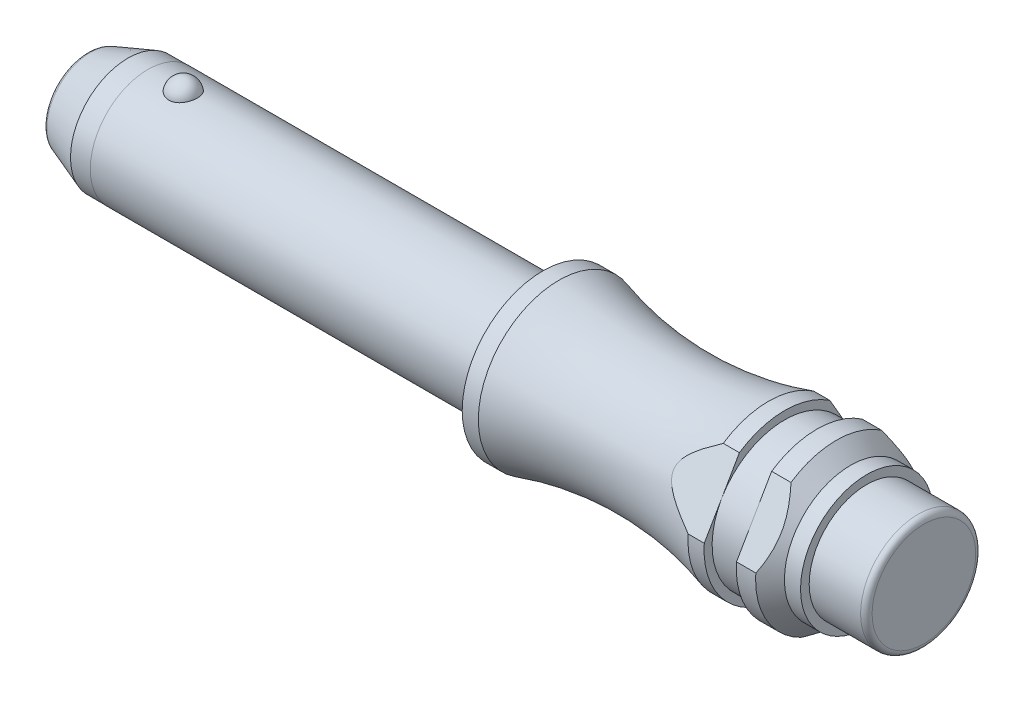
ISO-10303-21;
HEADER;
FILE_DESCRIPTION(('STEP AP214'),'2;1');
FILE_NAME('part.step','',(''),(''),'','','');
FILE_SCHEMA(('AUTOMOTIVE_DESIGN { 1 0 10303 214 1 1 1 1 }'));
ENDSEC;
DATA;
#1=APPLICATION_CONTEXT('core data for automotive mechanical design processes');
#2=APPLICATION_PROTOCOL_DEFINITION('international standard','automotive_design',2000,#1);
#3=PRODUCT_CONTEXT('',#1,'mechanical');
#4=PRODUCT('Part','Part','',(#3));
#5=PRODUCT_RELATED_PRODUCT_CATEGORY('part','',(#4));
#6=PRODUCT_DEFINITION_FORMATION('','',#4);
#7=PRODUCT_DEFINITION_CONTEXT('part definition',#1,'design');
#8=PRODUCT_DEFINITION('design','',#6,#7);
#9=PRODUCT_DEFINITION_SHAPE('','',#8);
#10=(LENGTH_UNIT() NAMED_UNIT(*) SI_UNIT(.MILLI.,.METRE.));
#11=(NAMED_UNIT(*) PLANE_ANGLE_UNIT() SI_UNIT($,.RADIAN.));
#12=(NAMED_UNIT(*) SI_UNIT($,.STERADIAN.) SOLID_ANGLE_UNIT());
#13=UNCERTAINTY_MEASURE_WITH_UNIT(LENGTH_MEASURE(1.E-05),#10,'distance_accuracy_value','');
#14=(GEOMETRIC_REPRESENTATION_CONTEXT(3) GLOBAL_UNCERTAINTY_ASSIGNED_CONTEXT((#13)) GLOBAL_UNIT_ASSIGNED_CONTEXT((#10,
#11,#12)) REPRESENTATION_CONTEXT('',''));
#15=CARTESIAN_POINT('',(0.,0.,0.));
#16=DIRECTION('',(0.,0.,1.));
#17=DIRECTION('',(1.,0.,0.));
#18=AXIS2_PLACEMENT_3D('',#15,#16,#17);
#19=CARTESIAN_POINT('',(-30.,0.,0.));
#20=DIRECTION('',(1.,0.,0.));
#21=DIRECTION('',(0.,0.,-1.));
#22=AXIS2_PLACEMENT_3D('',#19,#20,#21);
#23=CYLINDRICAL_SURFACE('',#22,5.);
#24=CARTESIAN_POINT('',(0.,0.,0.));
#25=DIRECTION('',(-1.,0.,0.));
#26=DIRECTION('',(0.,0.,1.));
#27=AXIS2_PLACEMENT_3D('',#24,#25,#26);
#28=CIRCLE('',#27,5.);
#29=CARTESIAN_POINT('',(0.,0.,5.));
#30=VERTEX_POINT('',#29);
#31=EDGE_CURVE('E364',#30,#30,#28,.T.);
#32=ORIENTED_EDGE('',*,*,#31,.T.);
#33=EDGE_LOOP('',(#32));
#34=FACE_BOUND('',#33,.T.);
#35=CARTESIAN_POINT('',(-32.4494897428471,-5.00000000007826,0.));
#36=CARTESIAN_POINT('',(-32.4494881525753,-4.99999882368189,0.0702328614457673));
#37=CARTESIAN_POINT('',(-32.4437364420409,-4.99850590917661,0.140487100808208));
#38=CARTESIAN_POINT('',(-32.420859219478,-4.99269075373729,0.279023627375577));
#39=CARTESIAN_POINT('',(-32.4037278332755,-4.98836705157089,0.347304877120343));
#40=CARTESIAN_POINT('',(-32.3585088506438,-4.97735918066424,0.479919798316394));
#41=CARTESIAN_POINT('',(-32.3304239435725,-4.97067559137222,0.544254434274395));
#42=CARTESIAN_POINT('',(-32.2639851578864,-4.95567593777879,0.667168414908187));
#43=CARTESIAN_POINT('',(-32.2256320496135,-4.94735999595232,0.725748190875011));
#44=CARTESIAN_POINT('',(-32.1396125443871,-4.93001456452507,0.835492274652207));
#45=CARTESIAN_POINT('',(-32.0919469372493,-4.92098513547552,0.886657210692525));
#46=CARTESIAN_POINT('',(-31.9885254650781,-4.90323088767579,0.980099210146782));
#47=CARTESIAN_POINT('',(-31.932769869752,-4.89450605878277,1.02237656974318));
#48=CARTESIAN_POINT('',(-31.8153285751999,-4.87846152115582,1.09637417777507));
#49=CARTESIAN_POINT('',(-31.7537149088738,-4.87112740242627,1.12820551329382));
#50=CARTESIAN_POINT('',(-31.6257828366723,-4.85860496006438,1.18097359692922));
#51=CARTESIAN_POINT('',(-31.5594651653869,-4.85341630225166,1.20191204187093));
#52=CARTESIAN_POINT('',(-31.4257000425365,-4.84589662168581,1.23187694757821));
#53=CARTESIAN_POINT('',(-31.3583170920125,-4.84350049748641,1.24117517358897));
#54=CARTESIAN_POINT('',(-31.2229049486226,-4.84162336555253,1.24847856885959));
#55=CARTESIAN_POINT('',(-31.1548758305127,-4.84214202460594,1.24648502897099));
#56=CARTESIAN_POINT('',(-31.0212965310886,-4.84600014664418,1.23139740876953));
#57=CARTESIAN_POINT('',(-30.9557239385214,-4.8492925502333,1.21848850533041));
#58=CARTESIAN_POINT('',(-30.82771910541,-4.858266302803,1.18219913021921));
#59=CARTESIAN_POINT('',(-30.7652869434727,-4.86394771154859,1.15881839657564));
#60=CARTESIAN_POINT('',(-30.6447806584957,-4.87712587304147,1.10204104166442));
#61=CARTESIAN_POINT('',(-30.5867434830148,-4.88463616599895,1.06856924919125));
#62=CARTESIAN_POINT('',(-30.4770539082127,-4.90063453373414,0.992614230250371));
#63=CARTESIAN_POINT('',(-30.4254022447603,-4.90912272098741,0.950129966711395));
#64=CARTESIAN_POINT('',(-30.3286190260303,-4.92638316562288,0.856199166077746));
#65=CARTESIAN_POINT('',(-30.2836700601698,-4.93515740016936,0.804564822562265));
#66=CARTESIAN_POINT('',(-30.2028875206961,-4.95184800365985,0.69447625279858));
#67=CARTESIAN_POINT('',(-30.16705485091,-4.95976428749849,0.636021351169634));
#68=CARTESIAN_POINT('',(-30.1048048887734,-4.9740289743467,0.512783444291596));
#69=CARTESIAN_POINT('',(-30.078567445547,-4.98034680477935,0.447905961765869));
#70=CARTESIAN_POINT('',(-30.0370581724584,-4.99054381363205,0.314550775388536));
#71=CARTESIAN_POINT('',(-30.0217866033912,-4.99442293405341,0.246072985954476));
#72=CARTESIAN_POINT('',(-30.0025418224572,-4.99933535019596,0.107190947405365));
#73=CARTESIAN_POINT('',(-29.9986100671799,-5.00035820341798,0.036780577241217));
#74=CARTESIAN_POINT('',(-30.0022590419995,-4.99941774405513,-0.103720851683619));
#75=CARTESIAN_POINT('',(-30.0098397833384,-4.99745442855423,-0.173811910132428));
#76=CARTESIAN_POINT('',(-30.0363157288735,-4.99075690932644,-0.311609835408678));
#77=CARTESIAN_POINT('',(-30.0551991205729,-4.98602559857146,-0.37931911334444));
#78=CARTESIAN_POINT('',(-30.1038135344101,-4.97430520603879,-0.510518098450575));
#79=CARTESIAN_POINT('',(-30.1335448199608,-4.96731606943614,-0.574007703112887));
#80=CARTESIAN_POINT('',(-30.2031709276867,-4.95183203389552,-0.695047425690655));
#81=CARTESIAN_POINT('',(-30.2430778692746,-4.94333534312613,-0.752590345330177));
#82=CARTESIAN_POINT('',(-30.3320421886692,-4.92578369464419,-0.86001296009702));
#83=CARTESIAN_POINT('',(-30.3810995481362,-4.91672873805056,-0.909892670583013));
#84=CARTESIAN_POINT('',(-30.4868344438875,-4.89913012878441,-1.0003205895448));
#85=CARTESIAN_POINT('',(-30.543473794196,-4.89058420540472,-1.04091296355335));
#86=CARTESIAN_POINT('',(-30.6630191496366,-4.87494427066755,-1.11186514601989));
#87=CARTESIAN_POINT('',(-30.7259244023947,-4.86785008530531,-1.14222618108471));
#88=CARTESIAN_POINT('',(-30.8549051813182,-4.8560745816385,-1.19128815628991));
#89=CARTESIAN_POINT('',(-30.9208932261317,-4.85134825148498,-1.2102081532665));
#90=CARTESIAN_POINT('',(-31.0552391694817,-4.84465528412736,-1.23673186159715));
#91=CARTESIAN_POINT('',(-31.1235967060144,-4.84268822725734,-1.24433729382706));
#92=CARTESIAN_POINT('',(-31.2590771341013,-4.84175714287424,-1.24795440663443));
#93=CARTESIAN_POINT('',(-31.3261927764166,-4.84272587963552,-1.24422565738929));
#94=CARTESIAN_POINT('',(-31.4588104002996,-4.8474093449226,-1.22585113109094));
#95=CARTESIAN_POINT('',(-31.5243124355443,-4.85112398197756,-1.21120571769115));
#96=CARTESIAN_POINT('',(-31.6516626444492,-4.86086448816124,-1.17149862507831));
#97=CARTESIAN_POINT('',(-31.7135216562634,-4.86688305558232,-1.14646983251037));
#98=CARTESIAN_POINT('',(-31.8321619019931,-4.88057172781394,-1.0867174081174));
#99=CARTESIAN_POINT('',(-31.888942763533,-4.88824195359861,-1.05199306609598));
#100=CARTESIAN_POINT('',(-31.9970258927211,-4.90457227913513,-0.973047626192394));
#101=CARTESIAN_POINT('',(-32.0482010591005,-4.91324864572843,-0.928655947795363));
#102=CARTESIAN_POINT('',(-32.1425161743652,-4.93053415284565,-0.832008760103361));
#103=CARTESIAN_POINT('',(-32.1856543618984,-4.93914327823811,-0.779751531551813));
#104=CARTESIAN_POINT('',(-32.2637389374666,-4.95557320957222,-0.6675172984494));
#105=CARTESIAN_POINT('',(-32.2984762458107,-4.96337158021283,-0.607391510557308));
#106=CARTESIAN_POINT('',(-32.3576025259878,-4.9771039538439,-0.482079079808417));
#107=CARTESIAN_POINT('',(-32.381996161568,-4.98303879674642,-0.416894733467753));
#108=CARTESIAN_POINT('',(-32.4170290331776,-4.99171424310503,-0.293316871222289));
#109=CARTESIAN_POINT('',(-32.4291825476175,-4.99480044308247,-0.235371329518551));
#110=CARTESIAN_POINT('',(-32.4454135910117,-4.99894382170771,-0.118288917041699));
#111=CARTESIAN_POINT('',(-32.4494910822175,-5.00000099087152,-0.0591520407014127));
#112=CARTESIAN_POINT('',(-32.4494897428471,-5.00000000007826,0.));
#113=B_SPLINE_CURVE_WITH_KNOTS('',3,(#35,#36,#37,#38,#39,#40,#41,#42,#43,#44,#45,#46,#47,#48,
#49,#50,#51,#52,#53,#54,#55,#56,#57,#58,#59,#60,#61,#62,#63,#64,#65,#66,#67,#68,#69,#70,#71,#72,
#73,#74,#75,#76,#77,#78,#79,#80,#81,#82,#83,#84,#85,#86,#87,#88,#89,#90,#91,#92,#93,#94,#95,#96,
#97,#98,#99,#100,#101,#102,#103,#104,#105,#106,#107,#108,#109,#110,#111,#112),.UNSPECIFIED.,.T.,
.F.,(4,2,2,2,2,2,2,2,2,2,2,2,2,2,2,2,2,2,2,2,2,2,2,2,2,2,2,2,2,2,2,2,2,2,2,2,2,2,4),(0.,
0.210486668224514,0.421082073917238,0.631625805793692,0.84215374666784,1.05266383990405,
1.26316691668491,1.47135283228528,1.67950630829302,1.88270343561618,2.08587733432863,
2.285672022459,2.48547170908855,2.68679816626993,2.88814780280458,3.09424809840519,
3.30036881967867,3.51017587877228,3.71998792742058,3.93056604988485,4.14114437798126,
4.35150301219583,4.56186675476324,4.77248222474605,4.98309727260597,5.19268890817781,
5.40225540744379,5.60767069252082,5.81305473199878,6.01377087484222,6.21448033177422,
6.41455888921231,6.61465210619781,6.81861270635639,7.02261795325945,7.23127214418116,
7.43983215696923,7.61710896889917,7.79438660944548),.UNSPECIFIED.);
#114=CARTESIAN_POINT('',(-32.4494897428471,-5.00000000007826,0.));
#115=VERTEX_POINT('',#114);
#116=EDGE_CURVE('E173',#115,#115,#113,.T.);
#117=ORIENTED_EDGE('',*,*,#116,.T.);
#118=EDGE_LOOP('',(#117));
#119=FACE_BOUND('',#118,.T.);
#120=CARTESIAN_POINT('',(-32.4494897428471,5.00000000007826,0.));
#121=CARTESIAN_POINT('',(-32.4494881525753,4.99999882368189,-0.0702328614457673));
#122=CARTESIAN_POINT('',(-32.4437364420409,4.99850590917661,-0.140487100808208));
#123=CARTESIAN_POINT('',(-32.420859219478,4.99269075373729,-0.279023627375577));
#124=CARTESIAN_POINT('',(-32.4037278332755,4.98836705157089,-0.347304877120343));
#125=CARTESIAN_POINT('',(-32.3585088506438,4.97735918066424,-0.479919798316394));
#126=CARTESIAN_POINT('',(-32.3304239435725,4.97067559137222,-0.544254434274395));
#127=CARTESIAN_POINT('',(-32.2639851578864,4.95567593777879,-0.667168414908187));
#128=CARTESIAN_POINT('',(-32.2256320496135,4.94735999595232,-0.725748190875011));
#129=CARTESIAN_POINT('',(-32.1396125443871,4.93001456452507,-0.835492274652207));
#130=CARTESIAN_POINT('',(-32.0919469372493,4.92098513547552,-0.886657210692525));
#131=CARTESIAN_POINT('',(-31.9885254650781,4.90323088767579,-0.980099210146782));
#132=CARTESIAN_POINT('',(-31.932769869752,4.89450605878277,-1.02237656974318));
#133=CARTESIAN_POINT('',(-31.8153285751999,4.87846152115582,-1.09637417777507));
#134=CARTESIAN_POINT('',(-31.7537149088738,4.87112740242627,-1.12820551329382));
#135=CARTESIAN_POINT('',(-31.6257828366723,4.85860496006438,-1.18097359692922));
#136=CARTESIAN_POINT('',(-31.5594651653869,4.85341630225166,-1.20191204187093));
#137=CARTESIAN_POINT('',(-31.4257000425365,4.84589662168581,-1.23187694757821));
#138=CARTESIAN_POINT('',(-31.3583170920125,4.84350049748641,-1.24117517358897));
#139=CARTESIAN_POINT('',(-31.2229049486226,4.84162336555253,-1.24847856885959));
#140=CARTESIAN_POINT('',(-31.1548758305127,4.84214202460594,-1.24648502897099));
#141=CARTESIAN_POINT('',(-31.0212965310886,4.84600014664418,-1.23139740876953));
#142=CARTESIAN_POINT('',(-30.9557239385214,4.8492925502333,-1.21848850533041));
#143=CARTESIAN_POINT('',(-30.82771910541,4.858266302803,-1.18219913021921));
#144=CARTESIAN_POINT('',(-30.7652869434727,4.86394771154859,-1.15881839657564));
#145=CARTESIAN_POINT('',(-30.6447806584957,4.87712587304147,-1.10204104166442));
#146=CARTESIAN_POINT('',(-30.5867434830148,4.88463616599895,-1.06856924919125));
#147=CARTESIAN_POINT('',(-30.4770539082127,4.90063453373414,-0.992614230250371));
#148=CARTESIAN_POINT('',(-30.4254022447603,4.90912272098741,-0.950129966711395));
#149=CARTESIAN_POINT('',(-30.3286190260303,4.92638316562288,-0.856199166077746));
#150=CARTESIAN_POINT('',(-30.2836700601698,4.93515740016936,-0.804564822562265));
#151=CARTESIAN_POINT('',(-30.2028875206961,4.95184800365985,-0.69447625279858));
#152=CARTESIAN_POINT('',(-30.16705485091,4.95976428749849,-0.636021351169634));
#153=CARTESIAN_POINT('',(-30.1048048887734,4.9740289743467,-0.512783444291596));
#154=CARTESIAN_POINT('',(-30.078567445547,4.98034680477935,-0.447905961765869));
#155=CARTESIAN_POINT('',(-30.0370581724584,4.99054381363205,-0.314550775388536));
#156=CARTESIAN_POINT('',(-30.0217866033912,4.99442293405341,-0.246072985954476));
#157=CARTESIAN_POINT('',(-30.0025418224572,4.99933535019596,-0.107190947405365));
#158=CARTESIAN_POINT('',(-29.9986100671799,5.00035820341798,-0.036780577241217));
#159=CARTESIAN_POINT('',(-30.0022590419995,4.99941774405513,0.103720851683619));
#160=CARTESIAN_POINT('',(-30.0098397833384,4.99745442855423,0.173811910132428));
#161=CARTESIAN_POINT('',(-30.0363157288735,4.99075690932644,0.311609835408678));
#162=CARTESIAN_POINT('',(-30.0551991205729,4.98602559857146,0.37931911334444));
#163=CARTESIAN_POINT('',(-30.1038135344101,4.97430520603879,0.510518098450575));
#164=CARTESIAN_POINT('',(-30.1335448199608,4.96731606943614,0.574007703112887));
#165=CARTESIAN_POINT('',(-30.2031709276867,4.95183203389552,0.695047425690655));
#166=CARTESIAN_POINT('',(-30.2430778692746,4.94333534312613,0.752590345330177));
#167=CARTESIAN_POINT('',(-30.3320421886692,4.92578369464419,0.86001296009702));
#168=CARTESIAN_POINT('',(-30.3810995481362,4.91672873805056,0.909892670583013));
#169=CARTESIAN_POINT('',(-30.4868344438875,4.89913012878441,1.0003205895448));
#170=CARTESIAN_POINT('',(-30.543473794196,4.89058420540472,1.04091296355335));
#171=CARTESIAN_POINT('',(-30.6630191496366,4.87494427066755,1.11186514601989));
#172=CARTESIAN_POINT('',(-30.7259244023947,4.86785008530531,1.14222618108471));
#173=CARTESIAN_POINT('',(-30.8549051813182,4.8560745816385,1.19128815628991));
#174=CARTESIAN_POINT('',(-30.9208932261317,4.85134825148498,1.2102081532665));
#175=CARTESIAN_POINT('',(-31.0552391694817,4.84465528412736,1.23673186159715));
#176=CARTESIAN_POINT('',(-31.1235967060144,4.84268822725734,1.24433729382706));
#177=CARTESIAN_POINT('',(-31.2590771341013,4.84175714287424,1.24795440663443));
#178=CARTESIAN_POINT('',(-31.3261927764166,4.84272587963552,1.24422565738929));
#179=CARTESIAN_POINT('',(-31.4588104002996,4.8474093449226,1.22585113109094));
#180=CARTESIAN_POINT('',(-31.5243124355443,4.85112398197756,1.21120571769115));
#181=CARTESIAN_POINT('',(-31.6516626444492,4.86086448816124,1.17149862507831));
#182=CARTESIAN_POINT('',(-31.7135216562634,4.86688305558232,1.14646983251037));
#183=CARTESIAN_POINT('',(-31.8321619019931,4.88057172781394,1.0867174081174));
#184=CARTESIAN_POINT('',(-31.888942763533,4.88824195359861,1.05199306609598));
#185=CARTESIAN_POINT('',(-31.9970258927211,4.90457227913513,0.973047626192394));
#186=CARTESIAN_POINT('',(-32.0482010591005,4.91324864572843,0.928655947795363));
#187=CARTESIAN_POINT('',(-32.1425161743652,4.93053415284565,0.832008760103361));
#188=CARTESIAN_POINT('',(-32.1856543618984,4.93914327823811,0.779751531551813));
#189=CARTESIAN_POINT('',(-32.2637389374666,4.95557320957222,0.6675172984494));
#190=CARTESIAN_POINT('',(-32.2984762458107,4.96337158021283,0.607391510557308));
#191=CARTESIAN_POINT('',(-32.3576025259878,4.9771039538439,0.482079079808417));
#192=CARTESIAN_POINT('',(-32.381996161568,4.98303879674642,0.416894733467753));
#193=CARTESIAN_POINT('',(-32.4170290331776,4.99171424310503,0.293316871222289));
#194=CARTESIAN_POINT('',(-32.4291825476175,4.99480044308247,0.235371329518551));
#195=CARTESIAN_POINT('',(-32.4454135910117,4.99894382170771,0.118288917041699));
#196=CARTESIAN_POINT('',(-32.4494910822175,5.00000099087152,0.0591520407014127));
#197=CARTESIAN_POINT('',(-32.4494897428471,5.00000000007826,0.));
#198=B_SPLINE_CURVE_WITH_KNOTS('',3,(#120,#121,#122,#123,#124,#125,#126,#127,#128,#129,#130,
#131,#132,#133,#134,#135,#136,#137,#138,#139,#140,#141,#142,#143,#144,#145,#146,#147,#148,#149,
#150,#151,#152,#153,#154,#155,#156,#157,#158,#159,#160,#161,#162,#163,#164,#165,#166,#167,#168,
#169,#170,#171,#172,#173,#174,#175,#176,#177,#178,#179,#180,#181,#182,#183,#184,#185,#186,#187,
#188,#189,#190,#191,#192,#193,#194,#195,#196,#197),.UNSPECIFIED.,.T.,.F.,(4,2,2,2,2,2,2,2,2,2,2,
2,2,2,2,2,2,2,2,2,2,2,2,2,2,2,2,2,2,2,2,2,2,2,2,2,2,2,4),(0.,0.210486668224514,
0.421082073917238,0.631625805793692,0.84215374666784,1.05266383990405,1.26316691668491,
1.47135283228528,1.67950630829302,1.88270343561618,2.08587733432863,2.285672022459,
2.48547170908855,2.68679816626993,2.88814780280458,3.09424809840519,3.30036881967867,
3.51017587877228,3.71998792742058,3.93056604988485,4.14114437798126,4.35150301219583,
4.56186675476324,4.77248222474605,4.98309727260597,5.19268890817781,5.40225540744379,
5.60767069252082,5.81305473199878,6.01377087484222,6.21448033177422,6.41455888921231,
6.61465210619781,6.81861270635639,7.02261795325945,7.23127214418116,7.43983215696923,
7.61710896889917,7.79438660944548),.UNSPECIFIED.);
#199=CARTESIAN_POINT('',(-32.4494897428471,5.00000000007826,0.));
#200=VERTEX_POINT('',#199);
#201=EDGE_CURVE('E366',#200,#200,#198,.T.);
#202=ORIENTED_EDGE('',*,*,#201,.T.);
#203=EDGE_LOOP('',(#202));
#204=FACE_BOUND('',#203,.T.);
#205=CARTESIAN_POINT('',(-34.3,0.,0.));
#206=DIRECTION('',(-1.,0.,0.));
#207=DIRECTION('',(0.,0.,1.));
#208=AXIS2_PLACEMENT_3D('',#205,#206,#207);
#209=CIRCLE('',#208,5.);
#210=CARTESIAN_POINT('',(-34.3,0.,5.));
#211=VERTEX_POINT('',#210);
#212=EDGE_CURVE('E44',#211,#211,#209,.T.);
#213=ORIENTED_EDGE('',*,*,#212,.F.);
#214=EDGE_LOOP('',(#213));
#215=FACE_BOUND('',#214,.T.);
#216=ADVANCED_FACE('F40',(#34,#119,#204,#215),#23,.T.);
#217=CARTESIAN_POINT('',(26.735,0.,0.));
#218=DIRECTION('',(-1.,0.,0.));
#219=DIRECTION('',(0.,0.,1.));
#220=AXIS2_PLACEMENT_3D('',#217,#218,#219);
#221=CONICAL_SURFACE('',#220,5.75,0.785398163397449);
#222=CARTESIAN_POINT('',(26.735,0.,0.));
#223=DIRECTION('',(-1.,0.,0.));
#224=DIRECTION('',(0.,0.,1.));
#225=AXIS2_PLACEMENT_3D('',#222,#223,#224);
#226=CIRCLE('',#225,5.75);
#227=CARTESIAN_POINT('',(26.735,0.,5.75));
#228=VERTEX_POINT('',#227);
#229=EDGE_CURVE('E220',#228,#228,#226,.T.);
#230=ORIENTED_EDGE('',*,*,#229,.T.);
#231=EDGE_LOOP('',(#230));
#232=FACE_BOUND('',#231,.T.);
#233=CARTESIAN_POINT('',(25.4848,0.50716061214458,6.98180407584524));
#234=CARTESIAN_POINT('',(25.5805338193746,0.697357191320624,6.871994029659));
#235=CARTESIAN_POINT('',(25.6693720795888,0.890441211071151,6.76051691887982));
#236=CARTESIAN_POINT('',(25.8296202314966,1.28269113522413,6.53405131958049));
#237=CARTESIAN_POINT('',(25.900966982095,1.48187623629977,6.4190517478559));
#238=CARTESIAN_POINT('',(26.0211830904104,1.88302628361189,6.18744766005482));
#239=CARTESIAN_POINT('',(26.0702943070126,2.0849354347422,6.07087535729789));
#240=CARTESIAN_POINT('',(26.1435662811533,2.49189311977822,5.83591822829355));
#241=CARTESIAN_POINT('',(26.1677638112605,2.69693657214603,5.71753633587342));
#242=CARTESIAN_POINT('',(26.1886042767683,3.09517839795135,5.48761131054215));
#243=CARTESIAN_POINT('',(26.1868817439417,3.28831224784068,5.37610543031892));
#244=CARTESIAN_POINT('',(26.1599704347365,3.67342464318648,5.15376068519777));
#245=CARTESIAN_POINT('',(26.1347697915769,3.86540255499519,5.04292218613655));
#246=CARTESIAN_POINT('',(26.0627727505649,4.24615812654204,4.82309285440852));
#247=CARTESIAN_POINT('',(26.0159839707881,4.43493689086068,4.71410138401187));
#248=CARTESIAN_POINT('',(25.9037261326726,4.80828410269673,4.49854927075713));
#249=CARTESIAN_POINT('',(25.8382513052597,4.99285123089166,4.39198938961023));
#250=CARTESIAN_POINT('',(25.7229955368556,5.2797117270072,4.22637040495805));
#251=CARTESIAN_POINT('',(25.6783873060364,5.3836037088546,4.16638834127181));
#252=CARTESIAN_POINT('',(25.5847710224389,5.58952497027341,4.0474996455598));
#253=CARTESIAN_POINT('',(25.5357768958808,5.69155898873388,3.98859027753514));
#254=CARTESIAN_POINT('',(25.4848,5.79283938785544,3.93011601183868));
#255=B_SPLINE_CURVE_WITH_KNOTS('',3,(#233,#234,#235,#236,#237,#238,#239,#240,#241,#242,#243,
#244,#245,#246,#247,#248,#249,#250,#251,#252,#253,#254),.UNSPECIFIED.,.F.,.F.,(4,2,2,2,2,2,2,2,
2,2,4),(0.,0.719072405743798,1.44070352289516,2.15428479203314,2.8668112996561,3.53460467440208,
4.20273576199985,4.8706312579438,5.53873318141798,5.92262075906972,6.30532993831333),.UNSPECIFIED.);
#256=CARTESIAN_POINT('',(25.485,0.50755794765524,6.9815746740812));
#257=VERTEX_POINT('',#256);
#258=CARTESIAN_POINT('',(25.485,5.79244205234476,3.93034541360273));
#259=VERTEX_POINT('',#258);
#260=EDGE_CURVE('E314',#257,#259,#255,.T.);
#261=ORIENTED_EDGE('',*,*,#260,.F.);
#262=CARTESIAN_POINT('',(25.485,0.,0.));
#263=DIRECTION('',(-1.,0.,0.));
#264=DIRECTION('',(0.,0.,1.));
#265=AXIS2_PLACEMENT_3D('',#262,#263,#264);
#266=CIRCLE('',#265,7.);
#267=CARTESIAN_POINT('',(25.485,-6.3,3.05122926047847));
#268=VERTEX_POINT('',#267);
#269=EDGE_CURVE('E214',#268,#257,#266,.T.);
#270=ORIENTED_EDGE('',*,*,#269,.F.);
#271=CARTESIAN_POINT('',(15.134696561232,-6.3,-16.1661074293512));
#272=CARTESIAN_POINT('',(15.4735657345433,-6.3,-15.8023788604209));
#273=CARTESIAN_POINT('',(15.8116647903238,-6.3,-15.4379288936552));
#274=CARTESIAN_POINT('',(16.4859009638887,-6.3,-14.7071861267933));
#275=CARTESIAN_POINT('',(16.8220379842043,-6.3,-14.3408932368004));
#276=CARTESIAN_POINT('',(17.492734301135,-6.3,-13.6051795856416));
#277=CARTESIAN_POINT('',(17.8272875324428,-6.3,-13.2357532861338));
#278=CARTESIAN_POINT('',(18.3268083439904,-6.3,-12.6795513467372));
#279=CARTESIAN_POINT('',(18.492927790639,-6.3,-12.4938099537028));
#280=CARTESIAN_POINT('',(18.8242987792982,-6.3,-12.1215486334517));
#281=CARTESIAN_POINT('',(18.9895503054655,-6.3,-11.9350286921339));
#282=CARTESIAN_POINT('',(19.5169720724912,-6.3,-11.3365644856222));
#283=CARTESIAN_POINT('',(19.8772552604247,-6.3,-10.9229527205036));
#284=CARTESIAN_POINT('',(20.5914287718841,-6.3,-10.0902451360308));
#285=CARTESIAN_POINT('',(20.9453193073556,-6.3,-9.67114949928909));
#286=CARTESIAN_POINT('',(21.4692270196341,-6.3,-9.0372157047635));
#287=CARTESIAN_POINT('',(21.6426040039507,-6.3,-8.82515442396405));
#288=CARTESIAN_POINT('',(21.9866665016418,-6.3,-8.39886181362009));
#289=CARTESIAN_POINT('',(22.1573520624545,-6.3,-8.18463052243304));
#290=CARTESIAN_POINT('',(22.495447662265,-6.3,-7.75364501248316));
#291=CARTESIAN_POINT('',(22.6628581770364,-6.3,-7.53689116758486));
#292=CARTESIAN_POINT('',(22.9936921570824,-6.3,-7.10036738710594));
#293=CARTESIAN_POINT('',(23.1571157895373,-6.3,-6.88059757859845));
#294=CARTESIAN_POINT('',(23.4576689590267,-6.3,-6.46684929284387));
#295=CARTESIAN_POINT('',(23.595410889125,-6.3,-6.27331650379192));
#296=CARTESIAN_POINT('',(23.8663592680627,-6.3,-5.88308560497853));
#297=CARTESIAN_POINT('',(23.9995656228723,-6.3,-5.68638742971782));
#298=CARTESIAN_POINT('',(24.2605972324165,-6.3,-5.28897850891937));
#299=CARTESIAN_POINT('',(24.3884133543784,-6.3,-5.08826174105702));
#300=CARTESIAN_POINT('',(24.6370479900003,-6.3,-4.68252701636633));
#301=CARTESIAN_POINT('',(24.757866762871,-6.3,-4.47750921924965));
#302=CARTESIAN_POINT('',(24.9881312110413,-6.3,-4.06709445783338));
#303=CARTESIAN_POINT('',(25.0977693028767,-6.3,-3.86180613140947));
#304=CARTESIAN_POINT('',(25.3064688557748,-6.3,-3.44582125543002));
#305=CARTESIAN_POINT('',(25.4055281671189,-6.3,-3.23512361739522));
#306=CARTESIAN_POINT('',(25.5900025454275,-6.3,-2.80853357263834));
#307=CARTESIAN_POINT('',(25.6754578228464,-6.3,-2.59265873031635));
#308=CARTESIAN_POINT('',(25.8297254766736,-6.3,-2.15510799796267));
#309=CARTESIAN_POINT('',(25.8985501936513,-6.3,-1.93343654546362));
#310=CARTESIAN_POINT('',(25.9982282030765,-6.3,-1.55273818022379));
#311=CARTESIAN_POINT('',(26.0342688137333,-6.3,-1.39506783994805));
#312=CARTESIAN_POINT('',(26.0954048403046,-6.3,-1.07757865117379));
#313=CARTESIAN_POINT('',(26.1204994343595,-6.3,-0.917759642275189));
#314=CARTESIAN_POINT('',(26.158763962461,-6.3,-0.597098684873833));
#315=CARTESIAN_POINT('',(26.1719641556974,-6.3,-0.436260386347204));
#316=CARTESIAN_POINT('',(26.1860244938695,-6.3,-0.114039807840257));
#317=CARTESIAN_POINT('',(26.1868843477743,-6.3,0.047342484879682));
#318=CARTESIAN_POINT('',(26.1753568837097,-6.3,0.395652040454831));
#319=CARTESIAN_POINT('',(26.1608154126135,-6.3,0.582510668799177));
#320=CARTESIAN_POINT('',(26.1158088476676,-6.3,0.954300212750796));
#321=CARTESIAN_POINT('',(26.0853405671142,-6.3,1.13923073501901));
#322=CARTESIAN_POINT('',(26.009547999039,-6.3,1.50812622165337));
#323=CARTESIAN_POINT('',(25.9640624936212,-6.3,1.69205765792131));
#324=CARTESIAN_POINT('',(25.8602451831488,-6.3,2.05617214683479));
#325=CARTESIAN_POINT('',(25.8019157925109,-6.3,2.23635589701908));
#326=CARTESIAN_POINT('',(25.660196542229,-6.3,2.63236093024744));
#327=CARTESIAN_POINT('',(25.5741179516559,-6.3,2.84721423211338));
#328=CARTESIAN_POINT('',(25.3888928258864,-6.3,3.27126164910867));
#329=CARTESIAN_POINT('',(25.2897397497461,-6.3,3.48045286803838));
#330=CARTESIAN_POINT('',(25.0807229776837,-6.3,3.8942667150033));
#331=CARTESIAN_POINT('',(24.9708239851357,-6.3,4.09887137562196));
#332=CARTESIAN_POINT('',(24.7427631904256,-6.3,4.50334533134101));
#333=CARTESIAN_POINT('',(24.6246027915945,-6.3,4.70321542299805));
#334=CARTESIAN_POINT('',(24.387023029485,-6.3,5.09013716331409));
#335=CARTESIAN_POINT('',(24.2678894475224,-6.3,5.27736520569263));
#336=CARTESIAN_POINT('',(24.0246819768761,-6.3,5.64859579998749));
#337=CARTESIAN_POINT('',(23.9006076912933,-6.3,5.83259809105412));
#338=CARTESIAN_POINT('',(23.6494687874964,-6.3,6.19627285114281));
#339=CARTESIAN_POINT('',(23.5224378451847,-6.3,6.37596865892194));
#340=CARTESIAN_POINT('',(23.265078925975,-6.3,6.7329098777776));
#341=CARTESIAN_POINT('',(23.1347518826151,-6.3,6.91015596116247));
#342=CARTESIAN_POINT('',(23.0030810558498,-6.3,7.08638037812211));
#343=B_SPLINE_CURVE_WITH_KNOTS('',3,(#271,#272,#273,#274,#275,#276,#277,#278,#279,#280,#281,
#282,#283,#284,#285,#286,#287,#288,#289,#290,#291,#292,#293,#294,#295,#296,#297,#298,#299,#300,
#301,#302,#303,#304,#305,#306,#307,#308,#309,#310,#311,#312,#313,#314,#315,#316,#317,#318,#319,
#320,#321,#322,#323,#324,#325,#326,#327,#328,#329,#330,#331,#332,#333,#334,#335,#336,#337,#338,
#339,#340,#341,#342),.UNSPECIFIED.,.F.,.F.,(4,2,2,2,2,2,2,2,2,2,2,2,2,2,2,2,2,2,2,2,2,2,2,2,2,2,
2,2,2,2,2,2,2,2,2,4),(0.,1.49137049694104,2.98281446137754,4.47799624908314,5.22556311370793,
5.97314357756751,7.61867081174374,9.26414338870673,10.0858721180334,10.9075863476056,
11.7291803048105,12.5507397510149,13.2633235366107,13.9759220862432,14.6896831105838,
15.4034176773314,16.101369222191,16.7994623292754,17.4954521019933,18.1909238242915,
18.6757993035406,19.1607111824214,19.6443859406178,20.1280721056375,20.6895984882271,
21.251237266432,21.8191130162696,22.3868821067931,23.0806874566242,23.774841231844,
24.4713569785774,25.1677546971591,25.8334137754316,26.4991264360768,27.1592730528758,
27.8192347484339),.UNSPECIFIED.);
#344=CARTESIAN_POINT('',(25.485,-6.3,-3.05122926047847));
#345=VERTEX_POINT('',#344);
#346=EDGE_CURVE('E258',#345,#268,#343,.T.);
#347=ORIENTED_EDGE('',*,*,#346,.F.);
#348=CARTESIAN_POINT('',(25.485,0.507557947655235,-6.9815746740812));
#349=VERTEX_POINT('',#348);
#350=EDGE_CURVE('E218',#349,#345,#266,.T.);
#351=ORIENTED_EDGE('',*,*,#350,.F.);
#352=CARTESIAN_POINT('',(25.4848,5.79283938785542,-3.93011601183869));
#353=CARTESIAN_POINT('',(25.5805338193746,5.60264280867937,-4.03992605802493));
#354=CARTESIAN_POINT('',(25.6693720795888,5.40955878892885,-4.15140316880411));
#355=CARTESIAN_POINT('',(25.8296202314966,5.01730886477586,-4.37786876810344));
#356=CARTESIAN_POINT('',(25.900966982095,4.81812376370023,-4.49286833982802));
#357=CARTESIAN_POINT('',(26.0211830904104,4.41697371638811,-4.72447242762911));
#358=CARTESIAN_POINT('',(26.0702943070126,4.2150645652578,-4.84104473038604));
#359=CARTESIAN_POINT('',(26.1435662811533,3.80810688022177,-5.07600185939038));
#360=CARTESIAN_POINT('',(26.1677638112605,3.60306342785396,-5.1943837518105));
#361=CARTESIAN_POINT('',(26.1886042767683,3.20482160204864,-5.42430877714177));
#362=CARTESIAN_POINT('',(26.1868817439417,3.01168775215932,-5.535814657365));
#363=CARTESIAN_POINT('',(26.1599704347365,2.62657535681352,-5.75815940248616));
#364=CARTESIAN_POINT('',(26.1347697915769,2.43459744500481,-5.86899790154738));
#365=CARTESIAN_POINT('',(26.0627727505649,2.05384187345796,-6.08882723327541));
#366=CARTESIAN_POINT('',(26.0159839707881,1.86506310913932,-6.19781870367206));
#367=CARTESIAN_POINT('',(25.9037261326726,1.49171589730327,-6.4133708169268));
#368=CARTESIAN_POINT('',(25.8382513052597,1.30714876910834,-6.5199306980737));
#369=CARTESIAN_POINT('',(25.7229955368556,1.0202882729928,-6.68554968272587));
#370=CARTESIAN_POINT('',(25.6783873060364,0.916396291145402,-6.74553174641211));
#371=CARTESIAN_POINT('',(25.5847710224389,0.710475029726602,-6.86442044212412));
#372=CARTESIAN_POINT('',(25.5357768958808,0.608441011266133,-6.92332981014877));
#373=CARTESIAN_POINT('',(25.4848,0.50716061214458,-6.98180407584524));
#374=B_SPLINE_CURVE_WITH_KNOTS('',3,(#352,#353,#354,#355,#356,#357,#358,#359,#360,#361,#362,
#363,#364,#365,#366,#367,#368,#369,#370,#371,#372,#373),.UNSPECIFIED.,.F.,.F.,(4,2,2,2,2,2,2,2,
2,2,4),(0.,0.719072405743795,1.44070352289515,2.15428479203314,2.8668112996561,3.53460467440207,
4.20273576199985,4.87063125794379,5.53873318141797,5.92262075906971,6.3053299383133),.UNSPECIFIED.);
#375=CARTESIAN_POINT('',(25.485,5.79244205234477,-3.93034541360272));
#376=VERTEX_POINT('',#375);
#377=EDGE_CURVE('E285',#376,#349,#374,.T.);
#378=ORIENTED_EDGE('',*,*,#377,.F.);
#379=EDGE_CURVE('E219',#259,#376,#266,.T.);
#380=ORIENTED_EDGE('',*,*,#379,.F.);
#381=EDGE_LOOP('',(#261,#270,#347,#351,#378,#380));
#382=FACE_BOUND('',#381,.T.);
#383=ADVANCED_FACE('F271',(#232,#382),#221,.T.);
#384=CARTESIAN_POINT('',(0.,0.,0.));
#385=DIRECTION('',(-1.,0.,0.));
#386=DIRECTION('',(0.,0.,1.));
#387=AXIS2_PLACEMENT_3D('',#384,#385,#386);
#388=CYLINDRICAL_SURFACE('',#387,7.);
#389=DIRECTION('',(-1.,0.,0.));
#390=VECTOR('',#389,1.);
#391=CARTESIAN_POINT('',(0.,5.79244205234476,3.93034541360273));
#392=LINE('',#391,#390);
#393=CARTESIAN_POINT('',(23.805,5.79244205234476,3.93034541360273));
#394=VERTEX_POINT('',#393);
#395=EDGE_CURVE('E321',#259,#394,#392,.T.);
#396=ORIENTED_EDGE('',*,*,#395,.F.);
#397=ORIENTED_EDGE('',*,*,#379,.T.);
#398=DIRECTION('',(-1.,0.,0.));
#399=VECTOR('',#398,1.);
#400=CARTESIAN_POINT('',(0.,5.79244205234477,-3.93034541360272));
#401=LINE('',#400,#399);
#402=CARTESIAN_POINT('',(23.805,5.79244205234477,-3.93034541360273));
#403=VERTEX_POINT('',#402);
#404=EDGE_CURVE('E294',#403,#376,#401,.F.);
#405=ORIENTED_EDGE('',*,*,#404,.F.);
#406=CARTESIAN_POINT('',(23.805,0.,0.));
#407=DIRECTION('',(-1.,0.,0.));
#408=DIRECTION('',(0.,0.,1.));
#409=AXIS2_PLACEMENT_3D('',#406,#407,#408);
#410=CIRCLE('',#409,7.);
#411=EDGE_CURVE('E213',#394,#403,#410,.T.);
#412=ORIENTED_EDGE('',*,*,#411,.F.);
#413=EDGE_LOOP('',(#396,#397,#405,#412));
#414=FACE_BOUND('',#413,.T.);
#415=ADVANCED_FACE('F276',(#414),#388,.T.);
#416=DIRECTION('',(-1.,0.,0.));
#417=VECTOR('',#416,1.);
#418=CARTESIAN_POINT('',(0.,0.50755794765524,6.9815746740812));
#419=LINE('',#418,#417);
#420=CARTESIAN_POINT('',(23.805,0.507557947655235,6.9815746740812));
#421=VERTEX_POINT('',#420);
#422=EDGE_CURVE('E311',#421,#257,#419,.F.);
#423=ORIENTED_EDGE('',*,*,#422,.F.);
#424=CARTESIAN_POINT('',(23.805,-6.3,3.05122926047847));
#425=VERTEX_POINT('',#424);
#426=EDGE_CURVE('E207',#425,#421,#410,.T.);
#427=ORIENTED_EDGE('',*,*,#426,.F.);
#428=DIRECTION('',(-1.,0.,0.));
#429=VECTOR('',#428,1.);
#430=CARTESIAN_POINT('',(0.,-6.3,3.05122926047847));
#431=LINE('',#430,#429);
#432=EDGE_CURVE('E267',#268,#425,#431,.T.);
#433=ORIENTED_EDGE('',*,*,#432,.F.);
#434=ORIENTED_EDGE('',*,*,#269,.T.);
#435=EDGE_LOOP('',(#423,#427,#433,#434));
#436=FACE_BOUND('',#435,.T.);
#437=ADVANCED_FACE('F403',(#436),#388,.T.);
#438=DIRECTION('',(-1.,0.,0.));
#439=VECTOR('',#438,1.);
#440=CARTESIAN_POINT('',(0.,0.507557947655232,-6.9815746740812));
#441=LINE('',#440,#439);
#442=CARTESIAN_POINT('',(23.805,0.507557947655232,-6.9815746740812));
#443=VERTEX_POINT('',#442);
#444=EDGE_CURVE('E293',#349,#443,#441,.T.);
#445=ORIENTED_EDGE('',*,*,#444,.F.);
#446=ORIENTED_EDGE('',*,*,#350,.T.);
#447=DIRECTION('',(-1.,0.,0.));
#448=VECTOR('',#447,1.);
#449=CARTESIAN_POINT('',(0.,-6.3,-3.05122926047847));
#450=LINE('',#449,#448);
#451=CARTESIAN_POINT('',(23.805,-6.3,-3.05122926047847));
#452=VERTEX_POINT('',#451);
#453=EDGE_CURVE('E268',#452,#345,#450,.F.);
#454=ORIENTED_EDGE('',*,*,#453,.F.);
#455=EDGE_CURVE('E212',#443,#452,#410,.T.);
#456=ORIENTED_EDGE('',*,*,#455,.F.);
#457=EDGE_LOOP('',(#445,#446,#454,#456));
#458=FACE_BOUND('',#457,.T.);
#459=ADVANCED_FACE('F418',(#458),#388,.T.);
#460=CARTESIAN_POINT('',(23.805,7.,0.));
#461=DIRECTION('',(1.,0.,0.));
#462=DIRECTION('',(0.,0.,-1.));
#463=AXIS2_PLACEMENT_3D('',#460,#461,#462);
#464=PLANE('',#463);
#465=DIRECTION('',(0.,-0.866025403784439,0.5));
#466=VECTOR('',#465,1.);
#467=CARTESIAN_POINT('',(23.805,8.4,2.42487113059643));
#468=LINE('',#467,#466);
#469=CARTESIAN_POINT('',(23.805,3.15,5.45596004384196));
#470=VERTEX_POINT('',#469);
#471=EDGE_CURVE('E312',#394,#470,#468,.T.);
#472=ORIENTED_EDGE('',*,*,#471,.F.);
#473=ORIENTED_EDGE('',*,*,#411,.T.);
#474=DIRECTION('',(0.,0.866025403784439,0.5));
#475=VECTOR('',#474,1.);
#476=CARTESIAN_POINT('',(23.805,8.4,-2.42487113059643));
#477=LINE('',#476,#475);
#478=CARTESIAN_POINT('',(23.805,3.15,-5.45596004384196));
#479=VERTEX_POINT('',#478);
#480=EDGE_CURVE('E352',#479,#403,#477,.T.);
#481=ORIENTED_EDGE('',*,*,#480,.F.);
#482=CARTESIAN_POINT('',(23.805,0.,0.));
#483=DIRECTION('',(-1.,0.,0.));
#484=DIRECTION('',(0.,0.,1.));
#485=AXIS2_PLACEMENT_3D('',#482,#483,#484);
#486=CIRCLE('',#485,6.3);
#487=EDGE_CURVE('E203',#470,#479,#486,.T.);
#488=ORIENTED_EDGE('',*,*,#487,.F.);
#489=EDGE_LOOP('',(#472,#473,#481,#488));
#490=FACE_BOUND('',#489,.T.);
#491=ADVANCED_FACE('F351',(#490),#464,.F.);
#492=EDGE_CURVE('E308',#470,#421,#468,.T.);
#493=ORIENTED_EDGE('',*,*,#492,.F.);
#494=CARTESIAN_POINT('',(23.805,-6.3,0.));
#495=VERTEX_POINT('',#494);
#496=EDGE_CURVE('E200',#495,#470,#486,.T.);
#497=ORIENTED_EDGE('',*,*,#496,.F.);
#498=DIRECTION('',(0.,0.,-1.));
#499=VECTOR('',#498,1.);
#500=CARTESIAN_POINT('',(23.805,-6.3,0.));
#501=LINE('',#500,#499);
#502=EDGE_CURVE('E58',#425,#495,#501,.T.);
#503=ORIENTED_EDGE('',*,*,#502,.F.);
#504=ORIENTED_EDGE('',*,*,#426,.T.);
#505=EDGE_LOOP('',(#493,#497,#503,#504));
#506=FACE_BOUND('',#505,.T.);
#507=ADVANCED_FACE('F344',(#506),#464,.F.);
#508=EDGE_CURVE('E66',#443,#479,#477,.T.);
#509=ORIENTED_EDGE('',*,*,#508,.F.);
#510=ORIENTED_EDGE('',*,*,#455,.T.);
#511=EDGE_CURVE('E360',#495,#452,#501,.T.);
#512=ORIENTED_EDGE('',*,*,#511,.F.);
#513=EDGE_CURVE('E208',#479,#495,#486,.T.);
#514=ORIENTED_EDGE('',*,*,#513,.F.);
#515=EDGE_LOOP('',(#509,#510,#512,#514));
#516=FACE_BOUND('',#515,.T.);
#517=ADVANCED_FACE('F357',(#516),#464,.F.);
#518=CARTESIAN_POINT('',(21.005,6.3,0.));
#519=DIRECTION('',(-1.,0.,0.));
#520=DIRECTION('',(0.,0.,1.));
#521=AXIS2_PLACEMENT_3D('',#518,#519,#520);
#522=PLANE('',#521);
#523=DIRECTION('',(0.,0.866025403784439,-0.5));
#524=VECTOR('',#523,1.);
#525=CARTESIAN_POINT('',(21.005,7.875,2.72798002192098));
#526=LINE('',#525,#524);
#527=CARTESIAN_POINT('',(21.005,0.507557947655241,6.9815746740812));
#528=VERTEX_POINT('',#527);
#529=CARTESIAN_POINT('',(21.005,3.15,5.45596004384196));
#530=VERTEX_POINT('',#529);
#531=EDGE_CURVE('E307',#528,#530,#526,.T.);
#532=ORIENTED_EDGE('',*,*,#531,.F.);
#533=CARTESIAN_POINT('',(21.005,0.,0.));
#534=DIRECTION('',(-1.,0.,0.));
#535=DIRECTION('',(0.,0.,1.));
#536=AXIS2_PLACEMENT_3D('',#533,#534,#535);
#537=CIRCLE('',#536,7.);
#538=CARTESIAN_POINT('',(21.005,-6.3,3.05122926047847));
#539=VERTEX_POINT('',#538);
#540=EDGE_CURVE('E186',#539,#528,#537,.T.);
#541=ORIENTED_EDGE('',*,*,#540,.F.);
#542=DIRECTION('',(0.,0.,1.));
#543=VECTOR('',#542,1.);
#544=CARTESIAN_POINT('',(21.005,-6.3,0.));
#545=LINE('',#544,#543);
#546=CARTESIAN_POINT('',(21.005,-6.3,0.));
#547=VERTEX_POINT('',#546);
#548=EDGE_CURVE('E386',#547,#539,#545,.T.);
#549=ORIENTED_EDGE('',*,*,#548,.F.);
#550=CARTESIAN_POINT('',(21.005,0.,0.));
#551=DIRECTION('',(-1.,0.,0.));
#552=DIRECTION('',(0.,0.,1.));
#553=AXIS2_PLACEMENT_3D('',#550,#551,#552);
#554=CIRCLE('',#553,6.3);
#555=EDGE_CURVE('E202',#547,#530,#554,.T.);
#556=ORIENTED_EDGE('',*,*,#555,.T.);
#557=EDGE_LOOP('',(#532,#541,#549,#556));
#558=FACE_BOUND('',#557,.T.);
#559=ADVANCED_FACE('F489',(#558),#522,.F.);
#560=CARTESIAN_POINT('',(21.005,5.79244205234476,3.93034541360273));
#561=VERTEX_POINT('',#560);
#562=EDGE_CURVE('E304',#530,#561,#526,.T.);
#563=ORIENTED_EDGE('',*,*,#562,.F.);
#564=CARTESIAN_POINT('',(21.005,3.15,-5.45596004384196));
#565=VERTEX_POINT('',#564);
#566=EDGE_CURVE('E196',#530,#565,#554,.T.);
#567=ORIENTED_EDGE('',*,*,#566,.T.);
#568=DIRECTION('',(0.,-0.866025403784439,-0.5));
#569=VECTOR('',#568,1.);
#570=CARTESIAN_POINT('',(21.005,7.875,-2.72798002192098));
#571=LINE('',#570,#569);
#572=CARTESIAN_POINT('',(21.005,5.79244205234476,-3.93034541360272));
#573=VERTEX_POINT('',#572);
#574=EDGE_CURVE('E355',#573,#565,#571,.T.);
#575=ORIENTED_EDGE('',*,*,#574,.F.);
#576=EDGE_CURVE('E195',#561,#573,#537,.T.);
#577=ORIENTED_EDGE('',*,*,#576,.F.);
#578=EDGE_LOOP('',(#563,#567,#575,#577));
#579=FACE_BOUND('',#578,.T.);
#580=ADVANCED_FACE('F494',(#579),#522,.F.);
#581=CARTESIAN_POINT('',(21.005,0.507557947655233,-6.9815746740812));
#582=VERTEX_POINT('',#581);
#583=EDGE_CURVE('E811',#565,#582,#571,.T.);
#584=ORIENTED_EDGE('',*,*,#583,.F.);
#585=EDGE_CURVE('E201',#565,#547,#554,.T.);
#586=ORIENTED_EDGE('',*,*,#585,.T.);
#587=CARTESIAN_POINT('',(21.005,-6.3,-3.05122926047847));
#588=VERTEX_POINT('',#587);
#589=EDGE_CURVE('E388',#588,#547,#545,.T.);
#590=ORIENTED_EDGE('',*,*,#589,.F.);
#591=EDGE_CURVE('E171',#582,#588,#537,.T.);
#592=ORIENTED_EDGE('',*,*,#591,.F.);
#593=EDGE_LOOP('',(#584,#586,#590,#592));
#594=FACE_BOUND('',#593,.T.);
#595=ADVANCED_FACE('F497',(#594),#522,.F.);
#596=CARTESIAN_POINT('',(0.,0.,0.));
#597=DIRECTION('',(-1.,0.,0.));
#598=DIRECTION('',(0.,0.,1.));
#599=AXIS2_PLACEMENT_3D('',#596,#597,#598);
#600=CYLINDRICAL_SURFACE('',#599,7.);
#601=DIRECTION('',(-1.,0.,0.));
#602=VECTOR('',#601,1.);
#603=CARTESIAN_POINT('',(0.,5.79244205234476,3.93034541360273));
#604=LINE('',#603,#602);
#605=CARTESIAN_POINT('',(19.605,5.79244205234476,3.93034541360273));
#606=VERTEX_POINT('',#605);
#607=EDGE_CURVE('E301',#561,#606,#604,.T.);
#608=ORIENTED_EDGE('',*,*,#607,.F.);
#609=ORIENTED_EDGE('',*,*,#576,.T.);
#610=DIRECTION('',(-1.,0.,0.));
#611=VECTOR('',#610,1.);
#612=CARTESIAN_POINT('',(0.,5.79244205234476,-3.93034541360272));
#613=LINE('',#612,#611);
#614=CARTESIAN_POINT('',(19.605,5.79244205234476,-3.93034541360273));
#615=VERTEX_POINT('',#614);
#616=EDGE_CURVE('E393',#615,#573,#613,.F.);
#617=ORIENTED_EDGE('',*,*,#616,.F.);
#618=CARTESIAN_POINT('',(19.605,0.,0.));
#619=DIRECTION('',(-1.,0.,0.));
#620=DIRECTION('',(0.,0.,1.));
#621=AXIS2_PLACEMENT_3D('',#618,#619,#620);
#622=CIRCLE('',#621,7.);
#623=EDGE_CURVE('E180',#606,#615,#622,.T.);
#624=ORIENTED_EDGE('',*,*,#623,.F.);
#625=EDGE_LOOP('',(#608,#609,#617,#624));
#626=FACE_BOUND('',#625,.T.);
#627=ADVANCED_FACE('F507',(#626),#600,.T.);
#628=DIRECTION('',(-1.,0.,0.));
#629=VECTOR('',#628,1.);
#630=CARTESIAN_POINT('',(0.,0.507557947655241,6.9815746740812));
#631=LINE('',#630,#629);
#632=CARTESIAN_POINT('',(19.605,0.50755794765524,6.9815746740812));
#633=VERTEX_POINT('',#632);
#634=EDGE_CURVE('E298',#633,#528,#631,.F.);
#635=ORIENTED_EDGE('',*,*,#634,.F.);
#636=CARTESIAN_POINT('',(19.605,-6.29999999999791,3.05122926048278));
#637=VERTEX_POINT('',#636);
#638=EDGE_CURVE('E181',#637,#633,#622,.T.);
#639=ORIENTED_EDGE('',*,*,#638,.F.);
#640=DIRECTION('',(-1.,0.,0.));
#641=VECTOR('',#640,1.);
#642=CARTESIAN_POINT('',(0.,-6.3,3.05122926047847));
#643=LINE('',#642,#641);
#644=EDGE_CURVE('E155',#539,#637,#643,.T.);
#645=ORIENTED_EDGE('',*,*,#644,.F.);
#646=ORIENTED_EDGE('',*,*,#540,.T.);
#647=EDGE_LOOP('',(#635,#639,#645,#646));
#648=FACE_BOUND('',#647,.T.);
#649=ADVANCED_FACE('F513',(#648),#600,.T.);
#650=DIRECTION('',(-1.,0.,0.));
#651=VECTOR('',#650,1.);
#652=CARTESIAN_POINT('',(0.,0.507557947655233,-6.9815746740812));
#653=LINE('',#652,#651);
#654=CARTESIAN_POINT('',(19.605,0.507557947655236,-6.9815746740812));
#655=VERTEX_POINT('',#654);
#656=EDGE_CURVE('E396',#582,#655,#653,.T.);
#657=ORIENTED_EDGE('',*,*,#656,.F.);
#658=ORIENTED_EDGE('',*,*,#591,.T.);
#659=DIRECTION('',(-1.,0.,0.));
#660=VECTOR('',#659,1.);
#661=CARTESIAN_POINT('',(0.,-6.3,-3.05122926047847));
#662=LINE('',#661,#660);
#663=CARTESIAN_POINT('',(19.605,-6.3,-3.05122926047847));
#664=VERTEX_POINT('',#663);
#665=EDGE_CURVE('E152',#664,#588,#662,.F.);
#666=ORIENTED_EDGE('',*,*,#665,.F.);
#667=EDGE_CURVE('E169',#655,#664,#622,.T.);
#668=ORIENTED_EDGE('',*,*,#667,.F.);
#669=EDGE_LOOP('',(#657,#658,#666,#668));
#670=FACE_BOUND('',#669,.T.);
#671=ADVANCED_FACE('F168',(#670),#600,.T.);
#672=CARTESIAN_POINT('',(10.5025,0.,0.));
#673=DIRECTION('',(-1.,0.,0.));
#674=DIRECTION('',(0.,0.,1.));
#675=AXIS2_PLACEMENT_3D('',#672,#673,#674);
#676=TOROIDAL_SURFACE('',#675,37.4836865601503,31.8136865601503);
#677=CARTESIAN_POINT('',(1.39999999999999,0.,0.));
#678=DIRECTION('',(-1.,0.,0.));
#679=DIRECTION('',(0.,0.,1.));
#680=AXIS2_PLACEMENT_3D('',#677,#678,#679);
#681=CIRCLE('',#680,7.);
#682=CARTESIAN_POINT('',(1.39999999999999,0.,7.));
#683=VERTEX_POINT('',#682);
#684=EDGE_CURVE('E188',#683,#683,#681,.T.);
#685=ORIENTED_EDGE('',*,*,#684,.F.);
#686=EDGE_LOOP('',(#685));
#687=FACE_BOUND('',#686,.T.);
#688=CARTESIAN_POINT('',(19.6052,5.79256070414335,3.93027690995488));
#689=CARTESIAN_POINT('',(19.5013010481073,5.73090252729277,3.9658752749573));
#690=CARTESIAN_POINT('',(19.3976991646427,5.66886044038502,4.00169529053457));
#691=CARTESIAN_POINT('',(19.1913328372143,5.54368279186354,4.07396663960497));
#692=CARTESIAN_POINT('',(19.0885686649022,5.48054689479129,4.11041816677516));
#693=CARTESIAN_POINT('',(18.8831924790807,5.35227338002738,4.18447691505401));
#694=CARTESIAN_POINT('',(18.7805916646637,5.28712226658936,4.22209192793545));
#695=CARTESIAN_POINT('',(18.5769871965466,5.15499228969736,4.29837720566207));
#696=CARTESIAN_POINT('',(18.4759833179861,5.08801368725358,4.33704731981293));
#697=CARTESIAN_POINT('',(18.2844450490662,4.95732097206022,4.41250279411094));
#698=CARTESIAN_POINT('',(18.1937377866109,4.89379767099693,4.44917798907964));
#699=CARTESIAN_POINT('',(18.0148241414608,4.76416729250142,4.52402012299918));
#700=CARTESIAN_POINT('',(17.9266174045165,4.69806058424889,4.56218684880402));
#701=CARTESIAN_POINT('',(17.7539405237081,4.56269110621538,4.64034245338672));
#702=CARTESIAN_POINT('',(17.6694600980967,4.49343825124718,4.68032560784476));
#703=CARTESIAN_POINT('',(17.5055451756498,4.35062370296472,4.76277962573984));
#704=CARTESIAN_POINT('',(17.4261070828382,4.2770651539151,4.80524867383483));
#705=CARTESIAN_POINT('',(17.2823961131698,4.13199569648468,4.88900456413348));
#706=CARTESIAN_POINT('',(17.2174018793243,4.06102808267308,4.92997773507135));
#707=CARTESIAN_POINT('',(17.0964967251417,3.9133592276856,5.0152343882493));
#708=CARTESIAN_POINT('',(17.0405841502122,3.83665903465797,5.05951726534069));
#709=CARTESIAN_POINT('',(16.9509226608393,3.69025154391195,5.14404566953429));
#710=CARTESIAN_POINT('',(16.9150246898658,3.62155492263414,5.18370768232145));
#711=CARTESIAN_POINT('',(16.8566104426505,3.48001832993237,5.265423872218));
#712=CARTESIAN_POINT('',(16.8340628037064,3.40718851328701,5.30747218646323));
#713=CARTESIAN_POINT('',(16.8078766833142,3.27021340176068,5.38655480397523));
#714=CARTESIAN_POINT('',(16.8019038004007,3.20640991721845,5.42339176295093));
#715=CARTESIAN_POINT('',(16.8028901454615,3.07888447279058,5.49701861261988));
#716=CARTESIAN_POINT('',(16.8098474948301,3.01516250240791,5.53380850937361));
#717=CARTESIAN_POINT('',(16.8356467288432,2.88995322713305,5.60609811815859));
#718=CARTESIAN_POINT('',(16.8544276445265,2.82845615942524,5.64160346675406));
#719=CARTESIAN_POINT('',(16.9017072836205,2.70839056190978,5.71092337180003));
#720=CARTESIAN_POINT('',(16.930211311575,2.64982365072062,5.7447369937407));
#721=CARTESIAN_POINT('',(17.0241990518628,2.4835904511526,5.84071177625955));
#722=CARTESIAN_POINT('',(17.0996175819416,2.38017432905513,5.90041910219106));
#723=CARTESIAN_POINT('',(17.2245674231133,2.23230269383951,5.98579283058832));
#724=CARTESIAN_POINT('',(17.2684788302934,2.18396087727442,6.01370299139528));
#725=CARTESIAN_POINT('',(17.3593574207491,2.08948722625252,6.06824737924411));
#726=CARTESIAN_POINT('',(17.4063230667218,2.0433542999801,6.094882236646));
#727=CARTESIAN_POINT('',(17.5352248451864,1.92232321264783,6.1647595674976));
#728=CARTESIAN_POINT('',(17.619278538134,1.84913240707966,6.20701629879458));
#729=CARTESIAN_POINT('',(17.7918027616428,1.706737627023,6.28922796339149));
#730=CARTESIAN_POINT('',(17.8802757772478,1.63753594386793,6.32918157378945));
#731=CARTESIAN_POINT('',(18.0605571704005,1.50200642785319,6.4074295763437));
#732=CARTESIAN_POINT('',(18.1523747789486,1.43568786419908,6.44571861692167));
#733=CARTESIAN_POINT('',(18.3382421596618,1.30543234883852,6.52092167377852));
#734=CARTESIAN_POINT('',(18.4322922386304,1.24149572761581,6.55783549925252));
#735=CARTESIAN_POINT('',(18.7033683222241,1.06141151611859,6.66180716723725));
#736=CARTESIAN_POINT('',(18.8823816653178,0.947512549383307,6.72756676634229));
#737=CARTESIAN_POINT('',(19.1526924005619,0.780051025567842,6.82425072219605));
#738=CARTESIAN_POINT('',(19.2427698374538,0.72498555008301,6.85604278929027));
#739=CARTESIAN_POINT('',(19.4235507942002,0.61565883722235,6.91916259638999));
#740=CARTESIAN_POINT('',(19.5142542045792,0.561397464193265,6.95049041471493));
#741=CARTESIAN_POINT('',(19.6051999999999,0.507439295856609,6.98164317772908));
#742=B_SPLINE_CURVE_WITH_KNOTS('',3,(#688,#689,#690,#691,#692,#693,#694,#695,#696,#697,#698,
#699,#700,#701,#702,#703,#704,#705,#706,#707,#708,#709,#710,#711,#712,#713,#714,#715,#716,#717,
#718,#719,#720,#721,#722,#723,#724,#725,#726,#727,#728,#729,#730,#731,#732,#733,#734,#735,#736,
#737,#738,#739,#740,#741),.UNSPECIFIED.,.F.,.F.,(4,2,2,2,2,2,2,2,2,2,2,2,2,2,2,2,2,2,2,2,2,2,2,
2,2,2,4),(0.,0.377863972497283,0.755845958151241,1.13750388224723,1.51910757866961,
1.86902123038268,2.2188850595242,2.5677139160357,2.91629114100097,3.22966926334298,
3.5429902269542,3.80332948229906,4.06305469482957,4.28370662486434,4.50432649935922,
4.723817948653,4.94342933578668,5.36452232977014,5.57756634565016,5.79050394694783,
6.1478360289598,6.5053713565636,6.86398198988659,7.22264219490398,7.88889430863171,
8.21966788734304,8.55038501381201),.UNSPECIFIED.);
#743=EDGE_CURVE('E367',#606,#633,#742,.T.);
#744=ORIENTED_EDGE('',*,*,#743,.F.);
#745=ORIENTED_EDGE('',*,*,#623,.T.);
#746=CARTESIAN_POINT('',(19.6052000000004,0.507439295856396,-6.9816431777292));
#747=CARTESIAN_POINT('',(19.5013010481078,0.56909747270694,-6.9460448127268));
#748=CARTESIAN_POINT('',(19.3976991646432,0.631139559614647,-6.91022479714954));
#749=CARTESIAN_POINT('',(19.191332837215,0.756317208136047,-6.83795344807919));
#750=CARTESIAN_POINT('',(19.0885686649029,0.819453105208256,-6.80150192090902));
#751=CARTESIAN_POINT('',(18.8831924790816,0.947726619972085,-6.72744317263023));
#752=CARTESIAN_POINT('',(18.7805916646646,1.01287773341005,-6.68982815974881));
#753=CARTESIAN_POINT('',(18.5769871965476,1.14500771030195,-6.61354288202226));
#754=CARTESIAN_POINT('',(18.4759833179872,1.21198631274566,-6.57487276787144));
#755=CARTESIAN_POINT('',(18.2844450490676,1.34267902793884,-6.49941729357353));
#756=CARTESIAN_POINT('',(18.1937377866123,1.40620232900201,-6.4627420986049));
#757=CARTESIAN_POINT('',(18.0148241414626,1.53583270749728,-6.3878999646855));
#758=CARTESIAN_POINT('',(17.9266174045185,1.60193941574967,-6.34973323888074));
#759=CARTESIAN_POINT('',(17.7539405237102,1.7373088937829,-6.2715776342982));
#760=CARTESIAN_POINT('',(17.6694600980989,1.80656174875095,-6.23159447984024));
#761=CARTESIAN_POINT('',(17.5055451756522,1.94937629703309,-6.14914046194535));
#762=CARTESIAN_POINT('',(17.4261070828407,2.02293484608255,-6.10667141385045));
#763=CARTESIAN_POINT('',(17.282396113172,2.16800430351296,-6.02291552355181));
#764=CARTESIAN_POINT('',(17.2174018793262,2.23897191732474,-5.98194235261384));
#765=CARTESIAN_POINT('',(17.0964967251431,2.38664077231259,-5.89668569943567));
#766=CARTESIAN_POINT('',(17.0405841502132,2.46334096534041,-5.85240282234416));
#767=CARTESIAN_POINT('',(16.95092266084,2.60974845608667,-5.76787441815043));
#768=CARTESIAN_POINT('',(16.9150246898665,2.6784450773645,-5.72821240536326));
#769=CARTESIAN_POINT('',(16.856610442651,2.81998167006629,-5.6464962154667));
#770=CARTESIAN_POINT('',(16.8340628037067,2.89281148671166,-5.60444790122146));
#771=CARTESIAN_POINT('',(16.8078766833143,3.029786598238,-5.52536528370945));
#772=CARTESIAN_POINT('',(16.8019038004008,3.09359008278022,-5.48852832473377));
#773=CARTESIAN_POINT('',(16.8028901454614,3.22111552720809,-5.41490147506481));
#774=CARTESIAN_POINT('',(16.8098474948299,3.28483749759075,-5.37811157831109));
#775=CARTESIAN_POINT('',(16.8356467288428,3.41004677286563,-5.3058219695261));
#776=CARTESIAN_POINT('',(16.854427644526,3.47154384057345,-5.27031662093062));
#777=CARTESIAN_POINT('',(16.9017072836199,3.59160943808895,-5.20099671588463));
#778=CARTESIAN_POINT('',(16.9302113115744,3.65017634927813,-5.16718309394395));
#779=CARTESIAN_POINT('',(17.0241990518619,3.81640954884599,-5.0712083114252));
#780=CARTESIAN_POINT('',(17.0996175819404,3.9198256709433,-5.01150098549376));
#781=CARTESIAN_POINT('',(17.2245674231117,4.06769730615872,-4.92612725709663));
#782=CARTESIAN_POINT('',(17.2684788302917,4.11603912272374,-4.8982170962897));
#783=CARTESIAN_POINT('',(17.3593574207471,4.21051277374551,-4.84367270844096));
#784=CARTESIAN_POINT('',(17.4063230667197,4.25664570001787,-4.81703785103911));
#785=CARTESIAN_POINT('',(17.5352248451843,4.37767678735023,-4.74716052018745));
#786=CARTESIAN_POINT('',(17.6192785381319,4.45086759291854,-4.70490378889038));
#787=CARTESIAN_POINT('',(17.7918027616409,4.59326237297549,-4.62269212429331));
#788=CARTESIAN_POINT('',(17.8802757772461,4.66246405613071,-4.58273851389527));
#789=CARTESIAN_POINT('',(18.0605571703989,4.7979935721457,-4.50449051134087));
#790=CARTESIAN_POINT('',(18.1523747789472,4.86431213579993,-4.46620147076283));
#791=CARTESIAN_POINT('',(18.3382421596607,4.9945676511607,-4.39099841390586));
#792=CARTESIAN_POINT('',(18.4322922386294,5.05850427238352,-4.35408458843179));
#793=CARTESIAN_POINT('',(18.7033683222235,5.238588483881,-4.25011292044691));
#794=CARTESIAN_POINT('',(18.8823816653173,5.35248745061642,-4.1843533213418));
#795=CARTESIAN_POINT('',(19.1526924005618,5.51994897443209,-4.08766936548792));
#796=CARTESIAN_POINT('',(19.2427698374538,5.57501444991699,-4.05587729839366));
#797=CARTESIAN_POINT('',(19.4235507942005,5.68434116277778,-3.99275749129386));
#798=CARTESIAN_POINT('',(19.5142542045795,5.73860253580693,-3.96142967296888));
#799=CARTESIAN_POINT('',(19.6052000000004,5.79256070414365,-3.9302769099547));
#800=B_SPLINE_CURVE_WITH_KNOTS('',3,(#746,#747,#748,#749,#750,#751,#752,#753,#754,#755,#756,
#757,#758,#759,#760,#761,#762,#763,#764,#765,#766,#767,#768,#769,#770,#771,#772,#773,#774,#775,
#776,#777,#778,#779,#780,#781,#782,#783,#784,#785,#786,#787,#788,#789,#790,#791,#792,#793,#794,
#795,#796,#797,#798,#799),.UNSPECIFIED.,.F.,.F.,(4,2,2,2,2,2,2,2,2,2,2,2,2,2,2,2,2,2,2,2,2,2,2,
2,2,2,4),(0.,0.377863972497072,0.755845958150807,1.13750388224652,1.51910757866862,
1.86902123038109,2.21888505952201,2.56771391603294,2.91629114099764,3.22966926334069,
3.54299022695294,3.80332948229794,4.06305469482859,4.28370662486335,4.5043264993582,
4.72381794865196,4.94342933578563,5.36452232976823,5.57756634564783,5.79050394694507,
6.14783602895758,6.50537135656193,6.86398198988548,7.22264219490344,7.88889430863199,
8.21966788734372,8.55038501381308),.UNSPECIFIED.);
#801=EDGE_CURVE('E161',#655,#615,#800,.T.);
#802=ORIENTED_EDGE('',*,*,#801,.F.);
#803=ORIENTED_EDGE('',*,*,#667,.T.);
#804=CARTESIAN_POINT('',(16.8023686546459,-6.3,0.));
#805=CARTESIAN_POINT('',(16.8023869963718,-6.3,-0.0804161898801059));
#806=CARTESIAN_POINT('',(16.8101190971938,-6.3,-0.160920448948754));
#807=CARTESIAN_POINT('',(16.839809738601,-6.3,-0.319271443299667));
#808=CARTESIAN_POINT('',(16.8617994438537,-6.3,-0.397111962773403));
#809=CARTESIAN_POINT('',(16.928428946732,-6.3,-0.579588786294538));
#810=CARTESIAN_POINT('',(16.9786574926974,-6.3,-0.682136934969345));
#811=CARTESIAN_POINT('',(17.0937168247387,-6.3,-0.878656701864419));
#812=CARTESIAN_POINT('',(17.1585952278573,-6.3,-0.97259891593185));
#813=CARTESIAN_POINT('',(17.2809184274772,-6.3,-1.13159962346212));
#814=CARTESIAN_POINT('',(17.3364232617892,-6.3,-1.19818798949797));
#815=CARTESIAN_POINT('',(17.4513529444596,-6.3,-1.32791408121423));
#816=CARTESIAN_POINT('',(17.5107794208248,-6.3,-1.39105035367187));
#817=CARTESIAN_POINT('',(17.6935693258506,-6.3,-1.57648461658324));
#818=CARTESIAN_POINT('',(17.8212175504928,-6.3,-1.69453241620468));
#819=CARTESIAN_POINT('',(18.0839276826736,-6.3,-1.92378861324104));
#820=CARTESIAN_POINT('',(18.2190353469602,-6.3,-2.03494317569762));
#821=CARTESIAN_POINT('',(18.4247315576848,-6.3,-2.19761750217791));
#822=CARTESIAN_POINT('',(18.4937562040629,-6.3,-2.25113204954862));
#823=CARTESIAN_POINT('',(18.6326506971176,-6.3,-2.35704633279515));
#824=CARTESIAN_POINT('',(18.7025205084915,-6.3,-2.40944611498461));
#825=CARTESIAN_POINT('',(18.9386145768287,-6.3,-2.58411505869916));
#826=CARTESIAN_POINT('',(19.1063893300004,-6.3,-2.70428605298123));
#827=CARTESIAN_POINT('',(19.4442622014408,-6.3,-2.94132413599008));
#828=CARTESIAN_POINT('',(19.6143605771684,-6.3,-3.05819085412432));
#829=CARTESIAN_POINT('',(19.9560377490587,-6.3,-3.28984961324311));
#830=CARTESIAN_POINT('',(20.1276169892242,-6.3,-3.40464099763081));
#831=CARTESIAN_POINT('',(20.4716085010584,-6.3,-3.63297073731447));
#832=CARTESIAN_POINT('',(20.644020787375,-6.3,-3.74650907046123));
#833=CARTESIAN_POINT('',(21.1622571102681,-6.3,-4.0865089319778));
#834=CARTESIAN_POINT('',(21.5086646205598,-6.3,-4.31207829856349));
#835=CARTESIAN_POINT('',(22.200684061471,-6.3,-4.76430352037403));
#836=CARTESIAN_POINT('',(22.5462961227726,-6.3,-4.99095917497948));
#837=CARTESIAN_POINT('',(23.2336866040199,-6.3,-5.44648419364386));
#838=CARTESIAN_POINT('',(23.5754754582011,-6.3,-5.67533774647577));
#839=CARTESIAN_POINT('',(24.2558184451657,-6.3,-6.13783547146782));
#840=CARTESIAN_POINT('',(24.5943724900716,-6.3,-6.37147977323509));
#841=CARTESIAN_POINT('',(25.2672862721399,-6.3,-6.84458923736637));
#842=CARTESIAN_POINT('',(25.601646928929,-6.3,-7.08405308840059));
#843=CARTESIAN_POINT('',(26.2655047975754,-6.3,-7.56966887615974));
#844=CARTESIAN_POINT('',(26.5950017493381,-6.3,-7.81582116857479));
#845=CARTESIAN_POINT('',(27.4159136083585,-6.3,-8.44348504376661));
#846=CARTESIAN_POINT('',(27.9037503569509,-6.3,-8.82970373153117));
#847=CARTESIAN_POINT('',(28.8644510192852,-6.3,-9.62029238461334));
#848=CARTESIAN_POINT('',(29.3373160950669,-6.3,-10.0246609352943));
#849=CARTESIAN_POINT('',(30.2660868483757,-6.3,-10.8524566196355));
#850=CARTESIAN_POINT('',(30.7219926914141,-6.3,-11.2758835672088));
#851=CARTESIAN_POINT('',(31.615105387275,-6.3,-12.1424102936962));
#852=CARTESIAN_POINT('',(32.0523044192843,-6.3,-12.5855181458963));
#853=CARTESIAN_POINT('',(32.9068719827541,-6.3,-13.4922673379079));
#854=CARTESIAN_POINT('',(33.32419638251,-6.3,-13.9559503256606));
#855=CARTESIAN_POINT('',(34.1363110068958,-6.3,-14.9027822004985));
#856=CARTESIAN_POINT('',(34.5310980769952,-6.3,-15.3859337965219));
#857=CARTESIAN_POINT('',(35.2962846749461,-6.3,-16.3709663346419));
#858=CARTESIAN_POINT('',(35.6666912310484,-6.3,-16.8728418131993));
#859=CARTESIAN_POINT('',(36.3815971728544,-6.3,-17.8946026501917));
#860=CARTESIAN_POINT('',(36.7261016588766,-6.3,-18.4144844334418));
#861=CARTESIAN_POINT('',(37.3133191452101,-6.3,-19.3524027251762));
#862=CARTESIAN_POINT('',(37.5614928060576,-6.3,-19.7670307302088));
#863=CARTESIAN_POINT('',(38.0407335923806,-6.3,-20.6059257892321));
#864=CARTESIAN_POINT('',(38.2718051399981,-6.3,-21.0301903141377));
#865=CARTESIAN_POINT('',(38.7162882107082,-6.3,-21.8878474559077));
#866=CARTESIAN_POINT('',(38.9297008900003,-6.3,-22.3212394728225));
#867=CARTESIAN_POINT('',(39.338320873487,-6.3,-23.1965239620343));
#868=CARTESIAN_POINT('',(39.5335269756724,-6.3,-23.6384169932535));
#869=CARTESIAN_POINT('',(40.0906310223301,-6.3,-24.974889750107));
#870=CARTESIAN_POINT('',(40.4245710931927,-6.3,-25.8813348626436));
#871=CARTESIAN_POINT('',(41.0139277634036,-6.3,-27.7193513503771));
#872=CARTESIAN_POINT('',(41.2693407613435,-6.3,-28.6509238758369));
#873=CARTESIAN_POINT('',(41.6993350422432,-6.3,-30.5351699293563));
#874=CARTESIAN_POINT('',(41.8737031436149,-6.3,-31.4878922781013));
#875=CARTESIAN_POINT('',(42.1384155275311,-6.3,-33.4049545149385));
#876=CARTESIAN_POINT('',(42.2287597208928,-6.3,-34.3692944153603));
#877=CARTESIAN_POINT('',(42.3240389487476,-6.3,-36.3024664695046));
#878=CARTESIAN_POINT('',(42.3289506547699,-6.3,-37.2712997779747));
#879=CARTESIAN_POINT('',(42.2526837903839,-6.3,-39.2055665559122));
#880=CARTESIAN_POINT('',(42.1715081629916,-6.3,-40.171000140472));
#881=CARTESIAN_POINT('',(41.9286285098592,-6.3,-42.0491955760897));
#882=CARTESIAN_POINT('',(41.7705604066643,-6.3,-42.9624291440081));
#883=CARTESIAN_POINT('',(41.3766244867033,-6.3,-44.7719528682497));
#884=CARTESIAN_POINT('',(41.1407589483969,-6.3,-45.6682435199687));
#885=CARTESIAN_POINT('',(40.5927549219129,-6.3,-47.4369941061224));
#886=CARTESIAN_POINT('',(40.2806323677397,-6.3,-48.3094589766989));
#887=CARTESIAN_POINT('',(39.5821877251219,-6.3,-50.0241707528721));
#888=CARTESIAN_POINT('',(39.1958662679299,-6.3,-50.8664179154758));
#889=CARTESIAN_POINT('',(38.3606042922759,-6.3,-52.4969926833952));
#890=CARTESIAN_POINT('',(37.9131477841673,-6.3,-53.2860808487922));
#891=CARTESIAN_POINT('',(36.95281564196,-6.3,-54.8233855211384));
#892=CARTESIAN_POINT('',(36.4399410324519,-6.3,-55.5716026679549));
#893=CARTESIAN_POINT('',(35.352389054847,-6.3,-57.0216545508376));
#894=CARTESIAN_POINT('',(34.7777134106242,-6.3,-57.7234905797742));
#895=CARTESIAN_POINT('',(33.5706338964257,-6.3,-59.0756316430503));
#896=CARTESIAN_POINT('',(32.9382302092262,-6.3,-59.7259368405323));
#897=CARTESIAN_POINT('',(31.626642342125,-6.3,-60.9641620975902));
#898=CARTESIAN_POINT('',(30.9479722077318,-6.3,-61.5526267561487));
#899=CARTESIAN_POINT('',(29.5432851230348,-6.3,-62.6700334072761));
#900=CARTESIAN_POINT('',(28.817268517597,-6.3,-63.1989758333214));
#901=CARTESIAN_POINT('',(27.3230752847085,-6.3,-64.1934796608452));
#902=CARTESIAN_POINT('',(26.5548996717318,-6.3,-64.65904258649));
#903=CARTESIAN_POINT('',(24.9818640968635,-6.3,-65.5234104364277));
#904=CARTESIAN_POINT('',(24.1770041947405,-6.3,-65.9222154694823));
#905=CARTESIAN_POINT('',(22.5403072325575,-6.3,-66.6484130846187));
#906=CARTESIAN_POINT('',(21.7086179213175,-6.3,-66.9761387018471));
#907=CARTESIAN_POINT('',(20.020545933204,-6.3,-67.5602192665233));
#908=CARTESIAN_POINT('',(19.1641633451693,-6.3,-67.8165744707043));
#909=CARTESIAN_POINT('',(17.4328207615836,-6.3,-68.2560571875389));
#910=CARTESIAN_POINT('',(16.5578609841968,-6.3,-68.4391855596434));
#911=CARTESIAN_POINT('',(14.795600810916,-6.3,-68.730893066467));
#912=CARTESIAN_POINT('',(13.9083004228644,-6.3,-68.8394722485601));
#913=CARTESIAN_POINT('',(12.1296444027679,-6.3,-68.9811403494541));
#914=CARTESIAN_POINT('',(11.2383018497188,-6.3,-69.0143935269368));
#915=CARTESIAN_POINT('',(9.45598677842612,-6.3,-69.005653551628));
#916=CARTESIAN_POINT('',(8.56501425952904,-6.3,-68.963660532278));
#917=CARTESIAN_POINT('',(6.78978336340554,-6.3,-68.8047315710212));
#918=CARTESIAN_POINT('',(5.90552495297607,-6.3,-68.6877959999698));
#919=CARTESIAN_POINT('',(4.15000750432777,-6.3,-68.3798254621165));
#920=CARTESIAN_POINT('',(3.278748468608,-6.3,-68.1887904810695));
#921=CARTESIAN_POINT('',(1.55579470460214,-6.3,-67.734096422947));
#922=CARTESIAN_POINT('',(0.704091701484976,-6.3,-67.4704686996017));
#923=CARTESIAN_POINT('',(-0.97409718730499,-6.3,-66.8724516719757));
#924=CARTESIAN_POINT('',(-1.80058309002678,-6.3,-66.5380624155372));
#925=CARTESIAN_POINT('',(-3.42248632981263,-6.3,-65.8009276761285));
#926=CARTESIAN_POINT('',(-4.21790367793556,-6.3,-65.3981822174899));
#927=CARTESIAN_POINT('',(-5.77205223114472,-6.3,-64.5272291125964));
#928=CARTESIAN_POINT('',(-6.53078339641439,-6.3,-64.0590213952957));
#929=CARTESIAN_POINT('',(-8.00707373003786,-6.3,-63.059924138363));
#930=CARTESIAN_POINT('',(-8.72458404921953,-6.3,-62.5289624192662));
#931=CARTESIAN_POINT('',(-10.1124327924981,-6.3,-61.4086078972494));
#932=CARTESIAN_POINT('',(-10.782771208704,-6.3,-60.8192150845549));
#933=CARTESIAN_POINT('',(-12.0715885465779,-6.3,-59.5862245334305));
#934=CARTESIAN_POINT('',(-12.6900674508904,-6.3,-58.9426267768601));
#935=CARTESIAN_POINT('',(-13.8708701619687,-6.3,-57.6058310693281));
#936=CARTESIAN_POINT('',(-14.4331938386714,-6.3,-56.9126330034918));
#937=CARTESIAN_POINT('',(-15.499496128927,-6.3,-55.4793224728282));
#938=CARTESIAN_POINT('',(-16.0032849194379,-6.3,-54.7390687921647));
#939=CARTESIAN_POINT('',(-16.9470078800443,-6.3,-53.2189243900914));
#940=CARTESIAN_POINT('',(-17.3869419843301,-6.3,-52.439033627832));
#941=CARTESIAN_POINT('',(-18.2000035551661,-6.3,-50.8451619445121));
#942=CARTESIAN_POINT('',(-18.5731299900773,-6.3,-50.0311804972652));
#943=CARTESIAN_POINT('',(-19.2501230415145,-6.3,-48.374911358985));
#944=CARTESIAN_POINT('',(-19.5539893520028,-6.3,-47.532623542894));
#945=CARTESIAN_POINT('',(-20.0922745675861,-6.3,-45.8201869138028));
#946=CARTESIAN_POINT('',(-20.326234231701,-6.3,-44.9498937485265));
#947=CARTESIAN_POINT('',(-20.7206724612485,-6.3,-43.1928199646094));
#948=CARTESIAN_POINT('',(-20.8811508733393,-6.3,-42.3060393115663));
#949=CARTESIAN_POINT('',(-21.1278139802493,-6.3,-40.5222337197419));
#950=CARTESIAN_POINT('',(-21.214000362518,-6.3,-39.6252090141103));
#951=CARTESIAN_POINT('',(-21.3118630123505,-6.3,-37.8271108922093));
#952=CARTESIAN_POINT('',(-21.3235386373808,-6.3,-36.9260374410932));
#953=CARTESIAN_POINT('',(-21.2724191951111,-6.3,-35.1144800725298));
#954=CARTESIAN_POINT('',(-21.2086702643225,-6.3,-34.2040231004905));
#955=CARTESIAN_POINT('',(-21.0061175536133,-6.3,-32.3915154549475));
#956=CARTESIAN_POINT('',(-20.8673136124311,-6.3,-31.4894647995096));
#957=CARTESIAN_POINT('',(-20.5162516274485,-6.3,-29.6997077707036));
#958=CARTESIAN_POINT('',(-20.3039870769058,-6.3,-28.8120026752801));
#959=CARTESIAN_POINT('',(-19.8082278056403,-6.3,-27.0567196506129));
#960=CARTESIAN_POINT('',(-19.5247313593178,-6.3,-26.1891422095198));
#961=CARTESIAN_POINT('',(-18.8805747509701,-6.3,-24.4559123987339));
#962=CARTESIAN_POINT('',(-18.518006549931,-6.3,-23.5909694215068));
#963=CARTESIAN_POINT('',(-17.7243229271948,-6.3,-21.893203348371));
#964=CARTESIAN_POINT('',(-17.2932092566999,-6.3,-21.0603794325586));
#965=CARTESIAN_POINT('',(-16.3668525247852,-6.3,-19.4315852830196));
#966=CARTESIAN_POINT('',(-15.8716277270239,-6.3,-18.6356046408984));
#967=CARTESIAN_POINT('',(-14.8216527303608,-6.3,-17.0837425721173));
#968=CARTESIAN_POINT('',(-14.2668931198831,-6.3,-16.3278675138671));
#969=CARTESIAN_POINT('',(-13.2949097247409,-6.3,-15.1008668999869));
#970=CARTESIAN_POINT('',(-12.8925065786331,-6.3,-14.6178961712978));
#971=CARTESIAN_POINT('',(-12.0650674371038,-6.3,-13.6716701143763));
#972=CARTESIAN_POINT('',(-11.6400298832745,-6.3,-13.2084161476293));
#973=CARTESIAN_POINT('',(-10.7691548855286,-6.3,-12.3018543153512));
#974=CARTESIAN_POINT('',(-10.3233156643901,-6.3,-11.8585481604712));
#975=CARTESIAN_POINT('',(-9.41278741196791,-6.3,-10.9917827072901));
#976=CARTESIAN_POINT('',(-8.94809869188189,-6.3,-10.5683230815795));
#977=CARTESIAN_POINT('',(-8.00146033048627,-6.3,-9.74034077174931));
#978=CARTESIAN_POINT('',(-7.51949589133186,-6.3,-9.33583504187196));
#979=CARTESIAN_POINT('',(-6.54079493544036,-6.3,-8.54509466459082));
#980=CARTESIAN_POINT('',(-6.0440575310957,-6.3,-8.15886111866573));
#981=CARTESIAN_POINT('',(-5.038203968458,-6.3,-7.40304348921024));
#982=CARTESIAN_POINT('',(-4.52908921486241,-6.3,-7.0334575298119));
#983=CARTESIAN_POINT('',(-3.50102747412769,-6.3,-6.30828708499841));
#984=CARTESIAN_POINT('',(-2.98208044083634,-6.3,-5.95270266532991));
#985=CARTESIAN_POINT('',(-2.05213361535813,-6.3,-5.32832380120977));
#986=CARTESIAN_POINT('',(-1.64242054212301,-6.3,-5.05759846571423));
#987=CARTESIAN_POINT('',(-1.02641363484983,-6.3,-4.65361123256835));
#988=CARTESIAN_POINT('',(-0.820815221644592,-6.3,-4.5192839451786));
#989=CARTESIAN_POINT('',(-0.409532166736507,-6.3,-4.2507675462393));
#990=CARTESIAN_POINT('',(-0.203847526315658,-6.3,-4.11657843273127));
#991=CARTESIAN_POINT('',(0.207191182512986,-6.3,-3.84757370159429));
#992=CARTESIAN_POINT('',(0.412545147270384,-6.3,-3.7127579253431));
#993=CARTESIAN_POINT('',(0.822203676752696,-6.3,-3.4415428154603));
#994=CARTESIAN_POINT('',(1.02650826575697,-6.3,-3.30514351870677));
#995=CARTESIAN_POINT('',(1.43295544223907,-6.3,-3.02942688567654));
#996=CARTESIAN_POINT('',(1.63509932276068,-6.3,-2.89011146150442));
#997=CARTESIAN_POINT('',(2.03578230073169,-6.3,-2.60640843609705));
#998=CARTESIAN_POINT('',(2.23432220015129,-6.3,-2.46202198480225));
#999=CARTESIAN_POINT('',(2.53412731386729,-6.3,-2.23381670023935));
#1000=CARTESIAN_POINT('',(2.63770427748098,-6.3,-2.1530468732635));
#1001=CARTESIAN_POINT('',(2.84228526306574,-6.3,-1.98820458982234));
#1002=CARTESIAN_POINT('',(2.94328821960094,-6.3,-1.90413080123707));
#1003=CARTESIAN_POINT('',(3.14120954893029,-6.3,-1.73192853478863));
#1004=CARTESIAN_POINT('',(3.23814052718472,-6.3,-1.64381465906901));
#1005=CARTESIAN_POINT('',(3.42640633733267,-6.3,-1.46184362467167));
#1006=CARTESIAN_POINT('',(3.51774563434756,-6.3,-1.36799117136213));
#1007=CARTESIAN_POINT('',(3.67417568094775,-6.3,-1.19219586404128));
#1008=CARTESIAN_POINT('',(3.74084269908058,-6.3,-1.11167421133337));
#1009=CARTESIAN_POINT('',(3.86608127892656,-6.3,-0.944168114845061));
#1010=CARTESIAN_POINT('',(3.92463605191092,-6.3,-0.857170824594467));
#1011=CARTESIAN_POINT('',(4.03011321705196,-6.3,-0.674139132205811));
#1012=CARTESIAN_POINT('',(4.07681941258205,-6.3,-0.577975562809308));
#1013=CARTESIAN_POINT('',(4.15034125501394,-6.3,-0.378429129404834));
#1014=CARTESIAN_POINT('',(4.17726403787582,-6.3,-0.275088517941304));
#1015=CARTESIAN_POINT('',(4.20114981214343,-6.3,-0.0961351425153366));
#1016=CARTESIAN_POINT('',(4.20463119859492,-6.3,-0.021391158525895));
#1017=CARTESIAN_POINT('',(4.19841705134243,-6.3,0.127574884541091));
#1018=CARTESIAN_POINT('',(4.18871388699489,-6.3,0.201796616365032));
#1019=CARTESIAN_POINT('',(4.15373136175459,-6.3,0.364854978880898));
#1020=CARTESIAN_POINT('',(4.12531424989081,-6.3,0.453002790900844));
#1021=CARTESIAN_POINT('',(4.05478339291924,-6.3,0.623610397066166));
#1022=CARTESIAN_POINT('',(4.01263623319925,-6.3,0.706055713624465));
#1023=CARTESIAN_POINT('',(3.91252987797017,-6.3,0.875909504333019));
#1024=CARTESIAN_POINT('',(3.85320654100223,-6.3,0.96249454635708));
#1025=CARTESIAN_POINT('',(3.72643151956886,-6.3,1.12957409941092));
#1026=CARTESIAN_POINT('',(3.65896536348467,-6.3,1.21005734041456));
#1027=CARTESIAN_POINT('',(3.51814087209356,-6.3,1.36657411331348));
#1028=CARTESIAN_POINT('',(3.44474712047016,-6.3,1.44257535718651));
#1029=CARTESIAN_POINT('',(3.29419296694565,-6.3,1.59056902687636));
#1030=CARTESIAN_POINT('',(3.21703599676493,-6.3,1.66256498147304));
#1031=CARTESIAN_POINT('',(3.05401210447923,-6.3,1.8088123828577));
#1032=CARTESIAN_POINT('',(2.96792844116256,-6.3,1.88282067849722));
#1033=CARTESIAN_POINT('',(2.79344188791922,-6.3,2.02806091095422));
#1034=CARTESIAN_POINT('',(2.70503862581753,-6.3,2.0992923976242));
#1035=CARTESIAN_POINT('',(2.4371841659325,-6.3,2.3098347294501));
#1036=CARTESIAN_POINT('',(2.25519244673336,-6.3,2.4459031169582));
#1037=CARTESIAN_POINT('',(1.88694663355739,-6.3,2.71299705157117));
#1038=CARTESIAN_POINT('',(1.70068344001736,-6.3,2.84400984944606));
#1039=CARTESIAN_POINT('',(1.3259229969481,-6.3,3.10264633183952));
#1040=CARTESIAN_POINT('',(1.13742655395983,-6.3,3.23027118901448));
#1041=CARTESIAN_POINT('',(0.758974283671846,-6.3,3.48365526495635));
#1042=CARTESIAN_POINT('',(0.56901741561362,-6.3,3.60941292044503));
#1043=CARTESIAN_POINT('',(0.188430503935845,-6.3,3.85993524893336));
#1044=CARTESIAN_POINT('',(-0.00219959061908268,-6.3,3.98469984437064));
#1045=CARTESIAN_POINT('',(-0.383415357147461,-6.3,4.23378358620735));
#1046=CARTESIAN_POINT('',(-0.574000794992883,-6.3,4.35810309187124));
#1047=CARTESIAN_POINT('',(-0.955011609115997,-6.3,4.60698651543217));
#1048=CARTESIAN_POINT('',(-1.14543698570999,-6.3,4.73155043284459));
#1049=CARTESIAN_POINT('',(-1.61733686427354,-6.3,5.04142467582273));
#1050=CARTESIAN_POINT('',(-1.89854947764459,-6.3,5.22713510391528));
#1051=CARTESIAN_POINT('',(-2.4592991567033,-6.3,5.60107284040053));
#1052=CARTESIAN_POINT('',(-2.73883622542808,-6.3,5.78930014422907));
#1053=CARTESIAN_POINT('',(-3.29566909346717,-6.3,6.1690453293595));
#1054=CARTESIAN_POINT('',(-3.57296490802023,-6.3,6.3605631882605));
#1055=CARTESIAN_POINT('',(-4.12483357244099,-6.3,6.74748179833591));
#1056=CARTESIAN_POINT('',(-4.39940641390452,-6.3,6.94288256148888));
#1057=CARTESIAN_POINT('',(-5.21855055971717,-6.3,7.53575359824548));
#1058=CARTESIAN_POINT('',(-5.75840457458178,-6.3,7.93979599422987));
#1059=CARTESIAN_POINT('',(-6.82246449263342,-6.3,8.76805217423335));
#1060=CARTESIAN_POINT('',(-7.34667019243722,-6.3,9.19226622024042));
#1061=CARTESIAN_POINT('',(-8.37554272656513,-6.3,10.0614705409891));
#1062=CARTESIAN_POINT('',(-8.88025189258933,-6.3,10.5064105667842));
#1063=CARTESIAN_POINT('',(-9.86889206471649,-6.3,11.4188621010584));
#1064=CARTESIAN_POINT('',(-10.3528227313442,-6.3,11.8863739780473));
#1065=CARTESIAN_POINT('',(-11.2974932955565,-6.3,12.8442639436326));
#1066=CARTESIAN_POINT('',(-11.7582345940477,-6.3,13.3346406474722));
#1067=CARTESIAN_POINT('',(-12.6542335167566,-6.3,14.3380594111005));
#1068=CARTESIAN_POINT('',(-13.089493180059,-6.3,14.8510996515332));
#1069=CARTESIAN_POINT('',(-14.13091194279,-6.3,16.146236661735));
#1070=CARTESIAN_POINT('',(-14.7210799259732,-6.3,16.941311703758));
#1071=CARTESIAN_POINT('',(-15.8352384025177,-6.3,18.576326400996));
#1072=CARTESIAN_POINT('',(-16.3592423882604,-6.3,19.4162568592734));
#1073=CARTESIAN_POINT('',(-17.3358824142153,-6.3,21.1374303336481));
#1074=CARTESIAN_POINT('',(-17.7884728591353,-6.3,22.0186992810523));
#1075=CARTESIAN_POINT('',(-18.6168745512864,-6.3,23.8167276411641));
#1076=CARTESIAN_POINT('',(-18.9926811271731,-6.3,24.7334892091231));
#1077=CARTESIAN_POINT('',(-19.6642308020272,-6.3,26.5990546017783));
#1078=CARTESIAN_POINT('',(-19.9597289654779,-6.3,27.5479467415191));
#1079=CARTESIAN_POINT('',(-20.4656539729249,-6.3,29.4681794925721));
#1080=CARTESIAN_POINT('',(-20.6760808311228,-6.3,30.439520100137));
#1081=CARTESIAN_POINT('',(-21.0091748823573,-6.3,32.3970226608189));
#1082=CARTESIAN_POINT('',(-21.1318538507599,-6.3,33.3831826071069));
#1083=CARTESIAN_POINT('',(-21.2876826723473,-6.3,35.3625458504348));
#1084=CARTESIAN_POINT('',(-21.3208365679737,-6.3,36.3557488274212));
#1085=CARTESIAN_POINT('',(-21.2973669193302,-6.3,38.2860348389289));
#1086=CARTESIAN_POINT('',(-21.2456135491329,-6.3,39.2231797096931));
#1087=CARTESIAN_POINT('',(-21.0613377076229,-6.3,41.0894869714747));
#1088=CARTESIAN_POINT('',(-20.9288182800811,-6.3,42.0186496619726));
#1089=CARTESIAN_POINT('',(-20.5836583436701,-6.3,43.8618228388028));
#1090=CARTESIAN_POINT('',(-20.3710306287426,-6.3,44.77583572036));
#1091=CARTESIAN_POINT('',(-19.8669535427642,-6.3,46.581867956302));
#1092=CARTESIAN_POINT('',(-19.5755051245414,-6.3,47.4738875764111));
#1093=CARTESIAN_POINT('',(-18.9250645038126,-6.3,49.2043055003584));
#1094=CARTESIAN_POINT('',(-18.5682058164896,-6.3,50.0435064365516));
#1095=CARTESIAN_POINT('',(-17.7843192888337,-6.3,51.6884627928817));
#1096=CARTESIAN_POINT('',(-17.3572929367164,-6.3,52.4942189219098));
#1097=CARTESIAN_POINT('',(-16.4360543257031,-6.3,54.0662985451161));
#1098=CARTESIAN_POINT('',(-15.9418461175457,-6.3,54.8326244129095));
#1099=CARTESIAN_POINT('',(-14.8897135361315,-6.3,56.3202164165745));
#1100=CARTESIAN_POINT('',(-14.3317894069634,-6.3,57.0414827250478));
#1101=CARTESIAN_POINT('',(-13.1635196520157,-6.3,58.4249489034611));
#1102=CARTESIAN_POINT('',(-12.5539099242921,-6.3,59.0877703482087));
#1103=CARTESIAN_POINT('',(-11.2807498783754,-6.3,60.359404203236));
#1104=CARTESIAN_POINT('',(-10.6172000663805,-6.3,60.9682171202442));
#1105=CARTESIAN_POINT('',(-9.24089208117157,-6.3,62.127380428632));
#1106=CARTESIAN_POINT('',(-8.52813522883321,-6.3,62.6777323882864));
#1107=CARTESIAN_POINT('',(-7.05849029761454,-6.3,63.7159707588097));
#1108=CARTESIAN_POINT('',(-6.30160230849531,-6.3,64.2038572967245));
#1109=CARTESIAN_POINT('',(-4.7538322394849,-6.3,65.1108377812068));
#1110=CARTESIAN_POINT('',(-3.96318369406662,-6.3,65.530330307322));
#1111=CARTESIAN_POINT('',(-2.34928294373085,-6.3,66.3010386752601));
#1112=CARTESIAN_POINT('',(-1.52603088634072,-6.3,66.6522548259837));
#1113=CARTESIAN_POINT('',(0.147194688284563,-6.3,67.2838613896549));
#1114=CARTESIAN_POINT('',(0.997167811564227,-6.3,67.564252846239));
#1115=CARTESIAN_POINT('',(2.71777433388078,-6.3,68.0521831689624));
#1116=CARTESIAN_POINT('',(3.58840771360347,-6.3,68.2597221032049));
#1117=CARTESIAN_POINT('',(5.34155027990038,-6.3,68.5999458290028));
#1118=CARTESIAN_POINT('',(6.224017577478,-6.3,68.7328465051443));
#1119=CARTESIAN_POINT('',(7.99701479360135,-6.3,68.9237622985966));
#1120=CARTESIAN_POINT('',(8.88754469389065,-6.3,68.9817775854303));
#1121=CARTESIAN_POINT('',(10.6703185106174,-6.3,69.0225039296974));
#1122=CARTESIAN_POINT('',(11.5625624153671,-6.3,69.0052154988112));
#1123=CARTESIAN_POINT('',(13.3424144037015,-6.3,68.8954603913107));
#1124=CARTESIAN_POINT('',(14.230022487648,-6.3,68.8029937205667));
#1125=CARTESIAN_POINT('',(15.9934270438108,-6.3,68.5436753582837));
#1126=CARTESIAN_POINT('',(16.8692341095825,-6.3,68.3768956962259));
#1127=CARTESIAN_POINT('',(18.603690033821,-6.3,67.9701713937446));
#1128=CARTESIAN_POINT('',(19.462338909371,-6.3,67.7302268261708));
#1129=CARTESIAN_POINT('',(21.1563847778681,-6.3,67.1789006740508));
#1130=CARTESIAN_POINT('',(21.9917818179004,-6.3,66.8675192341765));
#1131=CARTESIAN_POINT('',(23.6334081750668,-6.3,66.1755592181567));
#1132=CARTESIAN_POINT('',(24.4396374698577,-6.3,65.7949805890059));
#1133=CARTESIAN_POINT('',(26.0177152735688,-6.3,64.9671066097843));
#1134=CARTESIAN_POINT('',(26.7895422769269,-6.3,64.5197702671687));
#1135=CARTESIAN_POINT('',(28.2928378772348,-6.3,63.5617705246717));
#1136=CARTESIAN_POINT('',(29.0243064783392,-6.3,63.0511071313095));
#1137=CARTESIAN_POINT('',(30.4417427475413,-6.3,61.9701188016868));
#1138=CARTESIAN_POINT('',(31.1277103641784,-6.3,61.3997937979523));
#1139=CARTESIAN_POINT('',(32.4493436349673,-6.3,60.2035700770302));
#1140=CARTESIAN_POINT('',(33.0850091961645,-6.3,59.5776712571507));
#1141=CARTESIAN_POINT('',(34.3030830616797,-6.3,58.2732058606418));
#1142=CARTESIAN_POINT('',(34.8853593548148,-6.3,57.5945160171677));
#1143=CARTESIAN_POINT('',(35.9908870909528,-6.3,56.1906587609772));
#1144=CARTESIAN_POINT('',(36.5141384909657,-6.3,55.4654913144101));
#1145=CARTESIAN_POINT('',(37.4980328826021,-6.3,53.9738563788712));
#1146=CARTESIAN_POINT('',(37.9586754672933,-6.3,53.2073886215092));
#1147=CARTESIAN_POINT('',(38.8142396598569,-6.3,51.6386136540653));
#1148=CARTESIAN_POINT('',(39.2091610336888,-6.3,50.8363063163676));
#1149=CARTESIAN_POINT('',(39.9325223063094,-6.3,49.1973516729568));
#1150=CARTESIAN_POINT('',(40.2606115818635,-6.3,48.3605496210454));
#1151=CARTESIAN_POINT('',(40.8456450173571,-6.3,46.6624410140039));
#1152=CARTESIAN_POINT('',(41.1025890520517,-6.3,45.8011344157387));
#1153=CARTESIAN_POINT('',(41.5437728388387,-6.3,44.0600998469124));
#1154=CARTESIAN_POINT('',(41.7280122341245,-6.3,43.1803717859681));
#1155=CARTESIAN_POINT('',(42.0227930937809,-6.3,41.4086590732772));
#1156=CARTESIAN_POINT('',(42.1333340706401,-6.3,40.5166743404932));
#1157=CARTESIAN_POINT('',(42.2810461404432,-6.3,38.7175458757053));
#1158=CARTESIAN_POINT('',(42.3174619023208,-6.3,37.810340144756));
#1159=CARTESIAN_POINT('',(42.3148429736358,-6.3,35.9960502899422));
#1160=CARTESIAN_POINT('',(42.2758080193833,-6.3,35.0889661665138));
#1161=CARTESIAN_POINT('',(42.1230732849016,-6.3,33.2811121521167));
#1162=CARTESIAN_POINT('',(42.0093728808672,-6.3,32.3803423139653));
#1163=CARTESIAN_POINT('',(41.7087000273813,-6.3,30.591128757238));
#1164=CARTESIAN_POINT('',(41.5217266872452,-6.3,29.7026851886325));
#1165=CARTESIAN_POINT('',(41.0718076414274,-6.3,27.925347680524));
#1166=CARTESIAN_POINT('',(40.8073463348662,-6.3,27.0368375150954));
#1167=CARTESIAN_POINT('',(40.2068536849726,-6.3,25.2843711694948));
#1168=CARTESIAN_POINT('',(39.8708217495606,-6.3,24.4204151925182));
#1169=CARTESIAN_POINT('',(39.1305406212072,-6.3,22.7222588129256));
#1170=CARTESIAN_POINT('',(38.7262901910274,-6.3,21.8880589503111));
#1171=CARTESIAN_POINT('',(37.8535251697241,-6.3,20.2540295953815));
#1172=CARTESIAN_POINT('',(37.3850094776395,-6.3,19.4542006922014));
#1173=CARTESIAN_POINT('',(36.36366696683,-6.3,17.8543397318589));
#1174=CARTESIAN_POINT('',(35.8078269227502,-6.3,17.0562321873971));
#1175=CARTESIAN_POINT('',(34.6361364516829,-6.3,15.5054523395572));
#1176=CARTESIAN_POINT('',(34.0202835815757,-6.3,14.7527818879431));
#1177=CARTESIAN_POINT('',(32.7350838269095,-6.3,13.295105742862));
#1178=CARTESIAN_POINT('',(32.0657564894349,-6.3,12.5900828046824));
#1179=CARTESIAN_POINT('',(31.0268487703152,-6.3,11.5684507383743));
#1180=CARTESIAN_POINT('',(30.6747129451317,-6.3,11.2338786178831));
#1181=CARTESIAN_POINT('',(29.9596613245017,-6.3,10.57645997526));
#1182=CARTESIAN_POINT('',(29.5967458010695,-6.3,10.2536131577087));
#1183=CARTESIAN_POINT('',(28.7253867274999,-6.3,9.50237533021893));
#1184=CARTESIAN_POINT('',(28.2126376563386,-6.3,9.07897528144));
#1185=CARTESIAN_POINT('',(27.1713387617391,-6.3,8.25231212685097));
#1186=CARTESIAN_POINT('',(26.6427911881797,-6.3,7.84904617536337));
#1187=CARTESIAN_POINT('',(25.5726729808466,-6.3,7.06041738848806));
#1188=CARTESIAN_POINT('',(25.0311043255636,-6.3,6.67505185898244));
#1189=CARTESIAN_POINT('',(24.2113975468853,-6.3,6.10768281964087));
#1190=CARTESIAN_POINT('',(23.9369275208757,-6.3,5.92033392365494));
#1191=CARTESIAN_POINT('',(23.3860334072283,-6.3,5.54852976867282));
#1192=CARTESIAN_POINT('',(23.1096093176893,-6.3,5.36407451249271));
#1193=CARTESIAN_POINT('',(22.6148564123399,-6.3,5.0365780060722));
#1194=CARTESIAN_POINT('',(22.3967877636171,-6.3,4.89314231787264));
#1195=CARTESIAN_POINT('',(21.9601760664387,-6.3,4.60700838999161));
#1196=CARTESIAN_POINT('',(21.7416330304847,-6.3,4.46431013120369));
#1197=CARTESIAN_POINT('',(21.3046459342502,-6.3,4.17904667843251));
#1198=CARTESIAN_POINT('',(21.0862018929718,-6.3,4.03648145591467));
#1199=CARTESIAN_POINT('',(20.649899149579,-6.3,3.75046528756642));
#1200=CARTESIAN_POINT('',(20.4320404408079,-6.3,3.60701435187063));
#1201=CARTESIAN_POINT('',(19.9524291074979,-6.3,3.28781340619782));
#1202=CARTESIAN_POINT('',(19.6910014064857,-6.3,3.11156868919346));
#1203=CARTESIAN_POINT('',(19.3021238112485,-6.3,2.84201875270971));
#1204=CARTESIAN_POINT('',(19.1729368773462,-6.3,2.75122803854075));
#1205=CARTESIAN_POINT('',(18.9162791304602,-6.3,2.56726976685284));
#1206=CARTESIAN_POINT('',(18.7888081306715,-6.3,2.47410247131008));
#1207=CARTESIAN_POINT('',(18.550379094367,-6.3,2.29501384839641));
#1208=CARTESIAN_POINT('',(18.4391615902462,-6.3,2.20943943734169));
#1209=CARTESIAN_POINT('',(18.2195126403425,-6.3,2.03479426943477));
#1210=CARTESIAN_POINT('',(18.1110807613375,-6.3,1.94572406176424));
#1211=CARTESIAN_POINT('',(17.8984577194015,-6.3,1.76299742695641));
#1212=CARTESIAN_POINT('',(17.7942592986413,-6.3,1.66934951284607));
#1213=CARTESIAN_POINT('',(17.5920628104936,-6.3,1.47563892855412));
#1214=CARTESIAN_POINT('',(17.4940588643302,-6.3,1.37558252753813));
#1215=CARTESIAN_POINT('',(17.3261466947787,-6.3,1.18698334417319));
#1216=CARTESIAN_POINT('',(17.2544920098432,-6.3,1.10001522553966));
#1217=CARTESIAN_POINT('',(17.121009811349,-6.3,0.918655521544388));
#1218=CARTESIAN_POINT('',(17.0591769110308,-6.3,0.824268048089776));
#1219=CARTESIAN_POINT('',(16.9639838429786,-6.3,0.650515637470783));
#1220=CARTESIAN_POINT('',(16.9273516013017,-6.3,0.572977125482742));
#1221=CARTESIAN_POINT('',(16.8666370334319,-6.3,0.413178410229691));
#1222=CARTESIAN_POINT('',(16.8425146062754,-6.3,0.330934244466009));
#1223=CARTESIAN_POINT('',(16.8184455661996,-6.3,0.206499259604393));
#1224=CARTESIAN_POINT('',(16.812445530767,-6.3,0.165442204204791));
#1225=CARTESIAN_POINT('',(16.8044018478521,-6.3,0.0829313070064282));
#1226=CARTESIAN_POINT('',(16.8023591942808,-6.3,0.0414773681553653));
#1227=CARTESIAN_POINT('',(16.8023686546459,-6.3,0.));
#1228=B_SPLINE_CURVE_WITH_KNOTS('',3,(#804,#805,#806,#807,#808,#809,#810,#811,#812,#813,#814,
#815,#816,#817,#818,#819,#820,#821,#822,#823,#824,#825,#826,#827,#828,#829,#830,#831,#832,#833,
#834,#835,#836,#837,#838,#839,#840,#841,#842,#843,#844,#845,#846,#847,#848,#849,#850,#851,#852,
#853,#854,#855,#856,#857,#858,#859,#860,#861,#862,#863,#864,#865,#866,#867,#868,#869,#870,#871,
#872,#873,#874,#875,#876,#877,#878,#879,#880,#881,#882,#883,#884,#885,#886,#887,#888,#889,#890,
#891,#892,#893,#894,#895,#896,#897,#898,#899,#900,#901,#902,#903,#904,#905,#906,#907,#908,#909,
#910,#911,#912,#913,#914,#915,#916,#917,#918,#919,#920,#921,#922,#923,#924,#925,#926,#927,#928,
#929,#930,#931,#932,#933,#934,#935,#936,#937,#938,#939,#940,#941,#942,#943,#944,#945,#946,#947,
#948,#949,#950,#951,#952,#953,#954,#955,#956,#957,#958,#959,#960,#961,#962,#963,#964,#965,#966,
#967,#968,#969,#970,#971,#972,#973,#974,#975,#976,#977,#978,#979,#980,#981,#982,#983,#984,#985,
#986,#987,#988,#989,#990,#991,#992,#993,#994,#995,#996,#997,#998,#999,#1000,#1001,#1002,#1003,
#1004,#1005,#1006,#1007,#1008,#1009,#1010,#1011,#1012,#1013,#1014,#1015,#1016,#1017,#1018,#1019,
#1020,#1021,#1022,#1023,#1024,#1025,#1026,#1027,#1028,#1029,#1030,#1031,#1032,#1033,#1034,#1035,
#1036,#1037,#1038,#1039,#1040,#1041,#1042,#1043,#1044,#1045,#1046,#1047,#1048,#1049,#1050,#1051,
#1052,#1053,#1054,#1055,#1056,#1057,#1058,#1059,#1060,#1061,#1062,#1063,#1064,#1065,#1066,#1067,
#1068,#1069,#1070,#1071,#1072,#1073,#1074,#1075,#1076,#1077,#1078,#1079,#1080,#1081,#1082,#1083,
#1084,#1085,#1086,#1087,#1088,#1089,#1090,#1091,#1092,#1093,#1094,#1095,#1096,#1097,#1098,#1099,
#1100,#1101,#1102,#1103,#1104,#1105,#1106,#1107,#1108,#1109,#1110,#1111,#1112,#1113,#1114,#1115,
#1116,#1117,#1118,#1119,#1120,#1121,#1122,#1123,#1124,#1125,#1126,#1127,#1128,#1129,#1130,#1131,
#1132,#1133,#1134,#1135,#1136,#1137,#1138,#1139,#1140,#1141,#1142,#1143,#1144,#1145,#1146,#1147,
#1148,#1149,#1150,#1151,#1152,#1153,#1154,#1155,#1156,#1157,#1158,#1159,#1160,#1161,#1162,#1163,
#1164,#1165,#1166,#1167,#1168,#1169,#1170,#1171,#1172,#1173,#1174,#1175,#1176,#1177,#1178,#1179,
#1180,#1181,#1182,#1183,#1184,#1185,#1186,#1187,#1188,#1189,#1190,#1191,#1192,#1193,#1194,#1195,
#1196,#1197,#1198,#1199,#1200,#1201,#1202,#1203,#1204,#1205,#1206,#1207,#1208,#1209,#1210,#1211,
#1212,#1213,#1214,#1215,#1216,#1217,#1218,#1219,#1220,#1221,#1222,#1223,#1224,#1225,#1226,
#1227),.UNSPECIFIED.,.T.,.F.,(4,2,2,2,2,2,2,2,2,2,2,2,2,2,2,2,2,2,2,2,2,2,2,2,2,2,2,2,2,2,2,2,2,
2,2,2,2,2,2,2,2,2,2,2,2,2,2,2,2,2,2,2,2,2,2,2,2,2,2,2,2,2,2,2,2,2,2,2,2,2,2,2,2,2,2,2,2,2,2,2,2,
2,2,2,2,2,2,2,2,2,2,2,2,2,2,2,2,2,2,2,2,2,2,2,2,2,2,2,2,2,2,2,2,2,2,2,2,2,2,2,2,2,2,2,2,2,2,2,2,
2,2,2,2,2,2,2,2,2,2,2,2,2,2,2,2,2,2,2,2,2,2,2,2,2,2,2,2,2,2,2,2,2,2,2,2,2,2,2,2,2,2,2,2,2,2,2,2,
2,2,2,2,2,2,2,2,2,2,2,2,2,2,2,2,2,2,2,2,2,2,2,2,2,2,2,2,2,2,2,2,2,2,4),(0.,0.241068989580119,
0.482666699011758,0.823250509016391,1.16495768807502,1.42484233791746,1.68483556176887,
2.20588575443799,2.7305940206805,2.99260262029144,3.25460031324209,3.87364139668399,
4.49275163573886,5.1120544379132,5.73136816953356,6.97149495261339,8.21140091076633,
9.44536569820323,10.6793639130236,11.9130866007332,13.1468750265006,15.013097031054,
16.8791738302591,18.7452324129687,20.6120636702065,22.4828634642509,24.3539244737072,
26.2244437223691,28.0945936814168,29.5438937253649,30.9928177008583,32.4416467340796,
33.8905713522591,36.7848093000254,39.6791799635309,42.5811215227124,45.4830661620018,
48.3858032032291,51.2884410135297,54.0654991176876,56.8424758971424,59.6188729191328,
62.3952463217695,65.1133636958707,67.8314385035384,70.5494375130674,73.2674279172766,
75.9590182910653,78.650589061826,81.3420950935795,84.0335967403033,86.7122013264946,
89.3907962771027,92.0693597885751,94.7479215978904,97.4206367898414,100.09334724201,
102.766044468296,105.438742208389,108.110287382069,110.781830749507,113.453373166,
116.12491848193,118.79956706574,121.47421609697,124.148866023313,126.823522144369,
129.506623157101,132.189726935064,134.872872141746,137.556029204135,140.256443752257,
142.956863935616,145.657222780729,148.357604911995,151.092505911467,153.827412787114,
156.562561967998,159.297777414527,162.108230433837,164.918611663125,167.728194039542,
170.538221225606,172.423475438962,174.30885962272,176.194405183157,178.079919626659,
179.96708966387,181.854373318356,183.741443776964,185.628523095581,187.10173290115,
187.838503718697,188.575263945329,189.312222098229,190.049163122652,190.785635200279,
191.521941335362,191.915935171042,192.310089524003,192.702917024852,193.095426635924,
193.408688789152,193.722589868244,194.041862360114,194.359392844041,194.582726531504,
194.806189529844,195.082434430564,195.359356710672,195.67351732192,195.988244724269,
196.305015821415,196.621503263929,196.96199706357,197.302545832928,197.984056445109,
198.667186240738,199.350076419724,200.033509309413,200.716995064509,201.399639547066,
202.08228267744,203.093273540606,204.104262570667,205.115244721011,206.126229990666,
208.1487178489,210.171231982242,212.189074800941,214.20695057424,216.224704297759,
218.242296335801,221.209552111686,224.176201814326,227.144738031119,230.113454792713,
233.091126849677,236.068798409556,239.046070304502,242.023207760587,244.835472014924,
247.647630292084,250.459339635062,253.271014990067,256.00350124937,258.735929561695,
261.468193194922,264.200446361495,266.898816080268,269.597160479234,272.295432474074,
274.993698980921,277.675630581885,280.357550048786,283.039429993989,285.721307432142,
288.39538728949,291.069461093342,293.743516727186,296.417572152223,299.089041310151,
301.760507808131,304.431968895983,307.103432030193,309.776542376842,312.449652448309,
315.122765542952,317.7958835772,320.475442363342,323.15500310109,325.834581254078,
328.514168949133,331.207471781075,333.900779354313,336.594100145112,339.287438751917,
342.008087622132,344.728746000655,347.449427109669,350.17014129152,352.948095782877,
355.726073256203,358.504101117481,361.282176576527,364.196877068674,367.111696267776,
370.025454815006,371.482442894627,372.939394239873,374.933714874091,376.927752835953,
378.92148970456,379.918421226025,380.915353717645,381.698390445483,382.481406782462,
383.263954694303,384.0464936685,384.992291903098,385.465971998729,385.939600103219,
386.360539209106,386.781412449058,387.201530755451,387.621244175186,387.958882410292,
388.296334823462,388.552853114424,388.808543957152,388.932852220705,389.057191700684),.UNSPECIFIED.);
#1229=EDGE_CURVE('E149',#637,#664,#1228,.T.);
#1230=ORIENTED_EDGE('',*,*,#1229,.F.);
#1231=ORIENTED_EDGE('',*,*,#638,.T.);
#1232=EDGE_LOOP('',(#744,#745,#802,#803,#1230,#1231));
#1233=FACE_BOUND('',#1232,.T.);
#1234=ADVANCED_FACE('F177',(#687,#1233),#676,.F.);
#1235=CARTESIAN_POINT('',(0.,0.,0.));
#1236=DIRECTION('',(-1.,0.,0.));
#1237=DIRECTION('',(0.,0.,1.));
#1238=AXIS2_PLACEMENT_3D('',#1235,#1236,#1237);
#1239=CYLINDRICAL_SURFACE('',#1238,5.);
#1240=CARTESIAN_POINT('',(32.6,0.,0.));
#1241=DIRECTION('',(-1.,0.,0.));
#1242=DIRECTION('',(0.,0.,1.));
#1243=AXIS2_PLACEMENT_3D('',#1240,#1241,#1242);
#1244=CIRCLE('',#1243,5.);
#1245=CARTESIAN_POINT('',(32.6,0.,5.));
#1246=VERTEX_POINT('',#1245);
#1247=EDGE_CURVE('E373',#1246,#1246,#1244,.T.);
#1248=ORIENTED_EDGE('',*,*,#1247,.T.);
#1249=EDGE_LOOP('',(#1248));
#1250=FACE_BOUND('',#1249,.T.);
#1251=CARTESIAN_POINT('',(28.135,0.,0.));
#1252=DIRECTION('',(-1.,0.,0.));
#1253=DIRECTION('',(0.,0.,1.));
#1254=AXIS2_PLACEMENT_3D('',#1251,#1252,#1253);
#1255=CIRCLE('',#1254,5.);
#1256=CARTESIAN_POINT('',(28.135,0.,5.));
#1257=VERTEX_POINT('',#1256);
#1258=EDGE_CURVE('E162',#1257,#1257,#1255,.T.);
#1259=ORIENTED_EDGE('',*,*,#1258,.F.);
#1260=EDGE_LOOP('',(#1259));
#1261=FACE_BOUND('',#1260,.T.);
#1262=ADVANCED_FACE('F528',(#1250,#1261),#1239,.T.);
#1263=CARTESIAN_POINT('',(28.135,5.,0.));
#1264=DIRECTION('',(-1.,0.,0.));
#1265=DIRECTION('',(0.,0.,1.));
#1266=AXIS2_PLACEMENT_3D('',#1263,#1264,#1265);
#1267=PLANE('',#1266);
#1268=CARTESIAN_POINT('',(28.135,0.,0.));
#1269=DIRECTION('',(-1.,0.,0.));
#1270=DIRECTION('',(0.,0.,1.));
#1271=AXIS2_PLACEMENT_3D('',#1268,#1269,#1270);
#1272=CIRCLE('',#1271,5.75);
#1273=CARTESIAN_POINT('',(28.135,0.,5.75));
#1274=VERTEX_POINT('',#1273);
#1275=EDGE_CURVE('E224',#1274,#1274,#1272,.T.);
#1276=ORIENTED_EDGE('',*,*,#1275,.F.);
#1277=EDGE_LOOP('',(#1276));
#1278=FACE_BOUND('',#1277,.T.);
#1279=ORIENTED_EDGE('',*,*,#1258,.T.);
#1280=EDGE_LOOP('',(#1279));
#1281=FACE_BOUND('',#1280,.T.);
#1282=ADVANCED_FACE('F534',(#1278,#1281),#1267,.F.);
#1283=CARTESIAN_POINT('',(0.,0.,0.));
#1284=DIRECTION('',(-1.,0.,0.));
#1285=DIRECTION('',(0.,0.,1.));
#1286=AXIS2_PLACEMENT_3D('',#1283,#1284,#1285);
#1287=CYLINDRICAL_SURFACE('',#1286,5.75);
#1288=ORIENTED_EDGE('',*,*,#229,.F.);
#1289=EDGE_LOOP('',(#1288));
#1290=FACE_BOUND('',#1289,.T.);
#1291=ORIENTED_EDGE('',*,*,#1275,.T.);
#1292=EDGE_LOOP('',(#1291));
#1293=FACE_BOUND('',#1292,.T.);
#1294=ADVANCED_FACE('F279',(#1290,#1293),#1287,.T.);
#1295=CARTESIAN_POINT('',(0.,0.,0.));
#1296=DIRECTION('',(-1.,0.,0.));
#1297=DIRECTION('',(0.,0.,1.));
#1298=AXIS2_PLACEMENT_3D('',#1295,#1296,#1297);
#1299=CYLINDRICAL_SURFACE('',#1298,6.3);
#1300=ORIENTED_EDGE('',*,*,#566,.F.);
#1301=ORIENTED_EDGE('',*,*,#555,.F.);
#1302=ORIENTED_EDGE('',*,*,#585,.F.);
#1303=EDGE_LOOP('',(#1300,#1301,#1302));
#1304=FACE_BOUND('',#1303,.T.);
#1305=ORIENTED_EDGE('',*,*,#496,.T.);
#1306=ORIENTED_EDGE('',*,*,#487,.T.);
#1307=ORIENTED_EDGE('',*,*,#513,.T.);
#1308=EDGE_LOOP('',(#1305,#1306,#1307));
#1309=FACE_BOUND('',#1308,.T.);
#1310=ADVANCED_FACE('F348',(#1304,#1309),#1299,.T.);
#1311=CARTESIAN_POINT('',(0.,0.,0.));
#1312=DIRECTION('',(-1.,0.,0.));
#1313=DIRECTION('',(0.,0.,1.));
#1314=AXIS2_PLACEMENT_3D('',#1311,#1312,#1313);
#1315=CYLINDRICAL_SURFACE('',#1314,7.);
#1316=CARTESIAN_POINT('',(0.,0.,0.));
#1317=DIRECTION('',(-1.,0.,0.));
#1318=DIRECTION('',(0.,0.,1.));
#1319=AXIS2_PLACEMENT_3D('',#1316,#1317,#1318);
#1320=CIRCLE('',#1319,7.);
#1321=CARTESIAN_POINT('',(0.,0.,7.));
#1322=VERTEX_POINT('',#1321);
#1323=EDGE_CURVE('E323',#1322,#1322,#1320,.T.);
#1324=ORIENTED_EDGE('',*,*,#1323,.F.);
#1325=EDGE_LOOP('',(#1324));
#1326=FACE_BOUND('',#1325,.T.);
#1327=ORIENTED_EDGE('',*,*,#684,.T.);
#1328=EDGE_LOOP('',(#1327));
#1329=FACE_BOUND('',#1328,.T.);
#1330=ADVANCED_FACE('F551',(#1326,#1329),#1315,.T.);
#1331=CARTESIAN_POINT('',(0.,0.,0.));
#1332=DIRECTION('',(1.,0.,0.));
#1333=DIRECTION('',(0.,0.,-1.));
#1334=AXIS2_PLACEMENT_3D('',#1331,#1332,#1333);
#1335=PLANE('',#1334);
#1336=ORIENTED_EDGE('',*,*,#31,.F.);
#1337=EDGE_LOOP('',(#1336));
#1338=FACE_BOUND('',#1337,.T.);
#1339=ORIENTED_EDGE('',*,*,#1323,.T.);
#1340=EDGE_LOOP('',(#1339));
#1341=FACE_BOUND('',#1340,.T.);
#1342=ADVANCED_FACE('F558',(#1338,#1341),#1335,.F.);
#1343=CARTESIAN_POINT('',(33.1,5.,0.));
#1344=DIRECTION('',(-1.,0.,0.));
#1345=DIRECTION('',(0.,0.,1.));
#1346=AXIS2_PLACEMENT_3D('',#1343,#1344,#1345);
#1347=PLANE('',#1346);
#1348=CARTESIAN_POINT('',(33.1,0.,0.));
#1349=DIRECTION('',(-1.,0.,0.));
#1350=DIRECTION('',(0.,0.,1.));
#1351=AXIS2_PLACEMENT_3D('',#1348,#1349,#1350);
#1352=CIRCLE('',#1351,4.5);
#1353=CARTESIAN_POINT('',(33.1,0.,4.5));
#1354=VERTEX_POINT('',#1353);
#1355=EDGE_CURVE('E786',#1354,#1354,#1352,.F.);
#1356=ORIENTED_EDGE('',*,*,#1355,.T.);
#1357=EDGE_LOOP('',(#1356));
#1358=FACE_BOUND('',#1357,.T.);
#1359=ADVANCED_FACE('F564',(#1358),#1347,.F.);
#1360=CARTESIAN_POINT('',(11.254,-6.3,10.9119200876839));
#1361=DIRECTION('',(0.,-1.,0.));
#1362=DIRECTION('',(0.,0.,-1.));
#1363=AXIS2_PLACEMENT_3D('',#1360,#1361,#1362);
#1364=PLANE('',#1363);
#1365=ORIENTED_EDGE('',*,*,#589,.T.);
#1366=ORIENTED_EDGE('',*,*,#548,.T.);
#1367=ORIENTED_EDGE('',*,*,#644,.T.);
#1368=ORIENTED_EDGE('',*,*,#1229,.T.);
#1369=ORIENTED_EDGE('',*,*,#665,.T.);
#1370=EDGE_LOOP('',(#1365,#1366,#1367,#1368,#1369));
#1371=FACE_BOUND('',#1370,.T.);
#1372=ADVANCED_FACE('F151',(#1371),#1364,.T.);
#1373=CARTESIAN_POINT('',(11.254,12.6,0.));
#1374=DIRECTION('',(0.,0.5,-0.866025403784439));
#1375=DIRECTION('',(0.,0.866025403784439,0.5));
#1376=AXIS2_PLACEMENT_3D('',#1373,#1374,#1375);
#1377=PLANE('',#1376);
#1378=ORIENTED_EDGE('',*,*,#574,.T.);
#1379=ORIENTED_EDGE('',*,*,#583,.T.);
#1380=ORIENTED_EDGE('',*,*,#656,.T.);
#1381=ORIENTED_EDGE('',*,*,#801,.T.);
#1382=ORIENTED_EDGE('',*,*,#616,.T.);
#1383=EDGE_LOOP('',(#1378,#1379,#1380,#1381,#1382));
#1384=FACE_BOUND('',#1383,.T.);
#1385=ADVANCED_FACE('F576',(#1384),#1377,.T.);
#1386=CARTESIAN_POINT('',(11.254,12.6,0.));
#1387=DIRECTION('',(0.,0.5,0.866025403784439));
#1388=DIRECTION('',(0.,-0.866025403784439,0.5));
#1389=AXIS2_PLACEMENT_3D('',#1386,#1387,#1388);
#1390=PLANE('',#1389);
#1391=ORIENTED_EDGE('',*,*,#531,.T.);
#1392=ORIENTED_EDGE('',*,*,#562,.T.);
#1393=ORIENTED_EDGE('',*,*,#607,.T.);
#1394=ORIENTED_EDGE('',*,*,#743,.T.);
#1395=ORIENTED_EDGE('',*,*,#634,.T.);
#1396=EDGE_LOOP('',(#1391,#1392,#1393,#1394,#1395));
#1397=FACE_BOUND('',#1396,.T.);
#1398=ADVANCED_FACE('F250',(#1397),#1390,.T.);
#1399=ORIENTED_EDGE('',*,*,#502,.T.);
#1400=ORIENTED_EDGE('',*,*,#511,.T.);
#1401=ORIENTED_EDGE('',*,*,#453,.T.);
#1402=ORIENTED_EDGE('',*,*,#346,.T.);
#1403=ORIENTED_EDGE('',*,*,#432,.T.);
#1404=EDGE_LOOP('',(#1399,#1400,#1401,#1402,#1403));
#1405=FACE_BOUND('',#1404,.T.);
#1406=ADVANCED_FACE('F245',(#1405),#1364,.T.);
#1407=ORIENTED_EDGE('',*,*,#508,.T.);
#1408=ORIENTED_EDGE('',*,*,#480,.T.);
#1409=ORIENTED_EDGE('',*,*,#404,.T.);
#1410=ORIENTED_EDGE('',*,*,#377,.T.);
#1411=ORIENTED_EDGE('',*,*,#444,.T.);
#1412=EDGE_LOOP('',(#1407,#1408,#1409,#1410,#1411));
#1413=FACE_BOUND('',#1412,.T.);
#1414=ADVANCED_FACE('F249',(#1413),#1377,.T.);
#1415=ORIENTED_EDGE('',*,*,#471,.T.);
#1416=ORIENTED_EDGE('',*,*,#492,.T.);
#1417=ORIENTED_EDGE('',*,*,#422,.T.);
#1418=ORIENTED_EDGE('',*,*,#260,.T.);
#1419=ORIENTED_EDGE('',*,*,#395,.T.);
#1420=EDGE_LOOP('',(#1415,#1416,#1417,#1418,#1419));
#1421=FACE_BOUND('',#1420,.T.);
#1422=ADVANCED_FACE('F253',(#1421),#1390,.T.);
#1423=CARTESIAN_POINT('',(-31.2247448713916,4.75,0.));
#1424=DIRECTION('',(0.,1.,0.));
#1425=DIRECTION('',(1.,0.,0.));
#1426=AXIS2_PLACEMENT_3D('',#1423,#1424,#1425);
#1427=SPHERICAL_SURFACE('',#1426,1.25);
#1428=ORIENTED_EDGE('',*,*,#201,.F.);
#1429=EDGE_LOOP('',(#1428));
#1430=FACE_BOUND('',#1429,.T.);
#1431=ADVANCED_FACE('F449',(#1430),#1427,.T.);
#1432=CARTESIAN_POINT('',(-31.2247448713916,-4.75,0.));
#1433=DIRECTION('',(0.,1.,0.));
#1434=DIRECTION('',(1.,0.,0.));
#1435=AXIS2_PLACEMENT_3D('',#1432,#1433,#1434);
#1436=SPHERICAL_SURFACE('',#1435,1.25);
#1437=ORIENTED_EDGE('',*,*,#116,.F.);
#1438=EDGE_LOOP('',(#1437));
#1439=FACE_BOUND('',#1438,.T.);
#1440=ADVANCED_FACE('F447',(#1439),#1436,.T.);
#1441=CARTESIAN_POINT('',(32.6,0.,0.));
#1442=DIRECTION('',(-1.,0.,0.));
#1443=DIRECTION('',(0.,0.,1.));
#1444=AXIS2_PLACEMENT_3D('',#1441,#1442,#1443);
#1445=TOROIDAL_SURFACE('',#1444,4.5,0.5);
#1446=ORIENTED_EDGE('',*,*,#1355,.F.);
#1447=EDGE_LOOP('',(#1446));
#1448=FACE_BOUND('',#1447,.T.);
#1449=ORIENTED_EDGE('',*,*,#1247,.F.);
#1450=EDGE_LOOP('',(#1449));
#1451=FACE_BOUND('',#1450,.T.);
#1452=ADVANCED_FACE('F435',(#1448,#1451),#1445,.T.);
#1453=CARTESIAN_POINT('',(-34.3,0.,0.));
#1454=DIRECTION('',(-1.,0.,0.));
#1455=DIRECTION('',(0.,0.,1.));
#1456=AXIS2_PLACEMENT_3D('',#1453,#1454,#1455);
#1457=PLANE('',#1456);
#1458=CARTESIAN_POINT('',(-34.3,0.,0.));
#1459=DIRECTION('',(-1.,0.,0.));
#1460=DIRECTION('',(0.,0.,1.));
#1461=AXIS2_PLACEMENT_3D('',#1458,#1459,#1460);
#1462=CIRCLE('',#1461,4.99);
#1463=CARTESIAN_POINT('',(-34.3,0.,4.99));
#1464=VERTEX_POINT('',#1463);
#1465=EDGE_CURVE('E425',#1464,#1464,#1462,.T.);
#1466=ORIENTED_EDGE('',*,*,#1465,.F.);
#1467=EDGE_LOOP('',(#1466));
#1468=FACE_BOUND('',#1467,.T.);
#1469=ORIENTED_EDGE('',*,*,#212,.T.);
#1470=EDGE_LOOP('',(#1469));
#1471=FACE_BOUND('',#1470,.T.);
#1472=ADVANCED_FACE('F432',(#1468,#1471),#1457,.T.);
#1473=CARTESIAN_POINT('',(-34.3,0.,0.));
#1474=DIRECTION('',(-1.,0.,0.));
#1475=DIRECTION('',(0.,0.,1.));
#1476=AXIS2_PLACEMENT_3D('',#1473,#1474,#1475);
#1477=CYLINDRICAL_SURFACE('',#1476,4.99);
#1478=CARTESIAN_POINT('',(-36.0274747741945,0.,0.));
#1479=DIRECTION('',(1.,0.,0.));
#1480=DIRECTION('',(0.,0.,-1.));
#1481=AXIS2_PLACEMENT_3D('',#1478,#1479,#1480);
#1482=CIRCLE('',#1481,4.99);
#1483=CARTESIAN_POINT('',(-36.0274747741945,0.,-4.99));
#1484=VERTEX_POINT('',#1483);
#1485=EDGE_CURVE('E423',#1484,#1484,#1482,.F.);
#1486=ORIENTED_EDGE('',*,*,#1485,.F.);
#1487=EDGE_LOOP('',(#1486));
#1488=FACE_BOUND('',#1487,.T.);
#1489=ORIENTED_EDGE('',*,*,#1465,.T.);
#1490=EDGE_LOOP('',(#1489));
#1491=FACE_BOUND('',#1490,.T.);
#1492=ADVANCED_FACE('F430',(#1488,#1491),#1477,.T.);
#1493=CARTESIAN_POINT('',(-39.6,0.,0.));
#1494=DIRECTION('',(-1.,0.,0.));
#1495=DIRECTION('',(0.,0.,1.));
#1496=AXIS2_PLACEMENT_3D('',#1493,#1494,#1495);
#1497=PLANE('',#1496);
#1498=CARTESIAN_POINT('',(-39.6,0.,0.));
#1499=DIRECTION('',(-1.,0.,0.));
#1500=DIRECTION('',(0.,0.,1.));
#1501=AXIS2_PLACEMENT_3D('',#1498,#1499,#1500);
#1502=CIRCLE('',#1501,3.33960338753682);
#1503=CARTESIAN_POINT('',(-39.6,0.,3.33960338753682));
#1504=VERTEX_POINT('',#1503);
#1505=EDGE_CURVE('E50',#1504,#1504,#1502,.T.);
#1506=ORIENTED_EDGE('',*,*,#1505,.T.);
#1507=EDGE_LOOP('',(#1506));
#1508=FACE_BOUND('',#1507,.T.);
#1509=ADVANCED_FACE('F622',(#1508),#1497,.T.);
#1510=CARTESIAN_POINT('',(-39.1,0.,0.));
#1511=DIRECTION('',(-1.,0.,0.));
#1512=DIRECTION('',(0.,0.,1.));
#1513=AXIS2_PLACEMENT_3D('',#1510,#1511,#1512);
#1514=TOROIDAL_SURFACE('',#1513,3.33960338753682,0.5);
#1515=CARTESIAN_POINT('',(-39.2710100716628,0.,0.));
#1516=DIRECTION('',(-1.,0.,0.));
#1517=DIRECTION('',(0.,0.,1.));
#1518=AXIS2_PLACEMENT_3D('',#1515,#1516,#1517);
#1519=CIRCLE('',#1518,3.80944969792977);
#1520=CARTESIAN_POINT('',(-39.2710100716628,0.,3.80944969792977));
#1521=VERTEX_POINT('',#1520);
#1522=EDGE_CURVE('E12',#1521,#1521,#1519,.F.);
#1523=ORIENTED_EDGE('',*,*,#1522,.F.);
#1524=EDGE_LOOP('',(#1523));
#1525=FACE_BOUND('',#1524,.T.);
#1526=ORIENTED_EDGE('',*,*,#1505,.F.);
#1527=EDGE_LOOP('',(#1526));
#1528=FACE_BOUND('',#1527,.T.);
#1529=ADVANCED_FACE('F42',(#1525,#1528),#1514,.T.);
#1530=CARTESIAN_POINT('',(-39.6,0.,0.));
#1531=DIRECTION('',(1.,0.,0.));
#1532=DIRECTION('',(0.,0.,-1.));
#1533=AXIS2_PLACEMENT_3D('',#1530,#1531,#1532);
#1534=CONICAL_SURFACE('',#1533,3.68970715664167,0.349065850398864);
#1535=ORIENTED_EDGE('',*,*,#1522,.T.);
#1536=EDGE_LOOP('',(#1535));
#1537=FACE_BOUND('',#1536,.T.);
#1538=ORIENTED_EDGE('',*,*,#1485,.T.);
#1539=EDGE_LOOP('',(#1538));
#1540=FACE_BOUND('',#1539,.T.);
#1541=ADVANCED_FACE('F638',(#1537,#1540),#1534,.T.);
#1542=CLOSED_SHELL('',(#216,#383,#415,#437,#459,#491,#507,#517,#559,#580,#595,#627,#649,#671,
#1234,#1262,#1282,#1294,#1310,#1330,#1342,#1359,#1372,#1385,#1398,#1406,#1414,#1422,#1431,#1440,
#1452,#1472,#1492,#1509,#1529,#1541));
#1543=MANIFOLD_SOLID_BREP('B2',#1542);
#1544=ADVANCED_BREP_SHAPE_REPRESENTATION('',(#18,#1543),#14);
#1545=SHAPE_DEFINITION_REPRESENTATION(#9,#1544);
ENDSEC;
END-ISO-10303-21;
